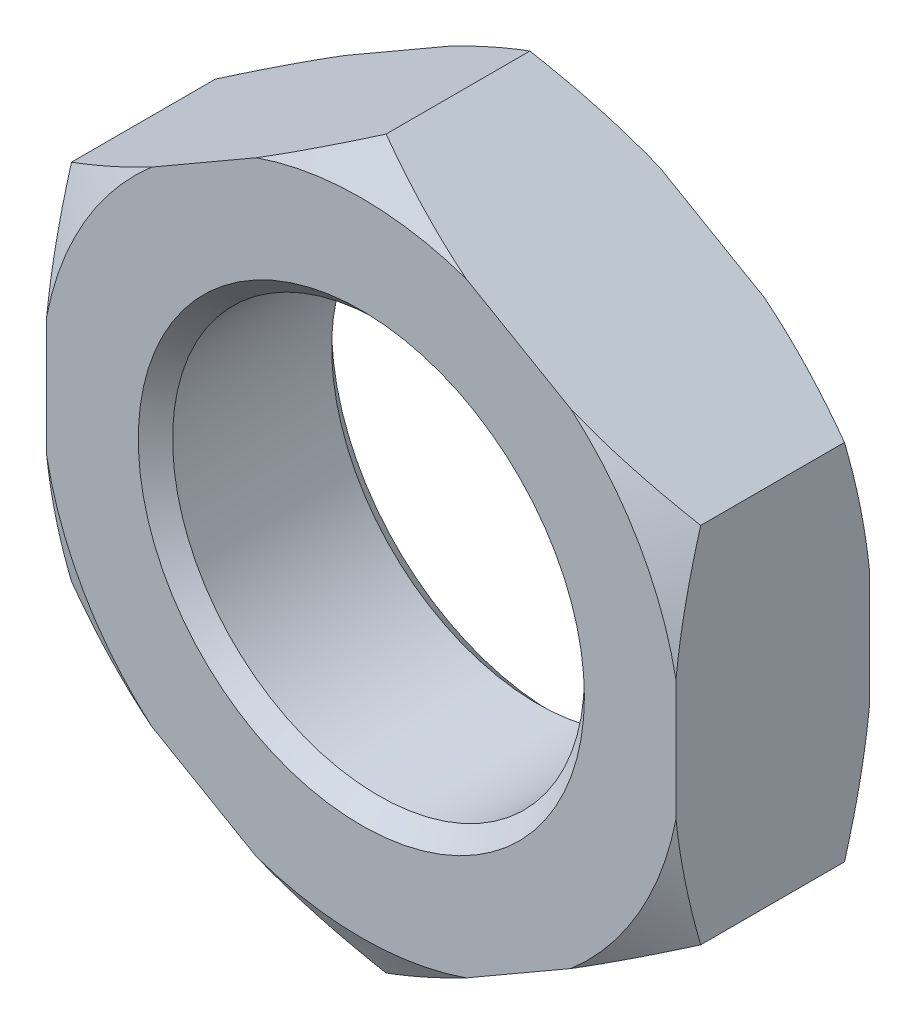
ISO-10303-21;
HEADER;
FILE_DESCRIPTION(('STEP AP214'),'2;1');
FILE_NAME('part.step','',(''),(''),'','','');
FILE_SCHEMA(('AUTOMOTIVE_DESIGN { 1 0 10303 214 1 1 1 1 }'));
ENDSEC;
DATA;
#1=APPLICATION_CONTEXT('core data for automotive mechanical design processes');
#2=APPLICATION_PROTOCOL_DEFINITION('international standard','automotive_design',2000,#1);
#3=PRODUCT_CONTEXT('',#1,'mechanical');
#4=PRODUCT('Part','Part','',(#3));
#5=PRODUCT_RELATED_PRODUCT_CATEGORY('part','',(#4));
#6=PRODUCT_DEFINITION_FORMATION('','',#4);
#7=PRODUCT_DEFINITION_CONTEXT('part definition',#1,'design');
#8=PRODUCT_DEFINITION('design','',#6,#7);
#9=PRODUCT_DEFINITION_SHAPE('','',#8);
#10=(LENGTH_UNIT() NAMED_UNIT(*) SI_UNIT(.MILLI.,.METRE.));
#11=(NAMED_UNIT(*) PLANE_ANGLE_UNIT() SI_UNIT($,.RADIAN.));
#12=(NAMED_UNIT(*) SI_UNIT($,.STERADIAN.) SOLID_ANGLE_UNIT());
#13=UNCERTAINTY_MEASURE_WITH_UNIT(LENGTH_MEASURE(1.E-05),#10,'distance_accuracy_value','');
#14=(GEOMETRIC_REPRESENTATION_CONTEXT(3) GLOBAL_UNCERTAINTY_ASSIGNED_CONTEXT((#13)) GLOBAL_UNIT_ASSIGNED_CONTEXT((#10,
#11,#12)) REPRESENTATION_CONTEXT('',''));
#15=CARTESIAN_POINT('',(0.,0.,0.));
#16=DIRECTION('',(0.,0.,1.));
#17=DIRECTION('',(1.,0.,0.));
#18=AXIS2_PLACEMENT_3D('',#15,#16,#17);
#19=CARTESIAN_POINT('',(27.5,15.8771324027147,8.45));
#20=DIRECTION('',(-0.5,-0.866025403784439,0.));
#21=DIRECTION('',(0.866025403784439,-0.5,0.));
#22=AXIS2_PLACEMENT_3D('',#19,#20,#21);
#23=PLANE('',#22);
#24=CARTESIAN_POINT('',(-19.0969929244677,42.7799188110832,2.42993770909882));
#25=CARTESIAN_POINT('',(-18.6649838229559,42.530498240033,2.19677431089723));
#26=CARTESIAN_POINT('',(-18.2324512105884,42.2807754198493,1.96490507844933));
#27=CARTESIAN_POINT('',(-17.3662472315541,41.7806723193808,1.5040082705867));
#28=CARTESIAN_POINT('',(-16.9325758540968,41.530292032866,1.2749807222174));
#29=CARTESIAN_POINT('',(-15.6296270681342,40.7780342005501,0.59249418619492));
#30=CARTESIAN_POINT('',(-14.7585156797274,40.2750978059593,0.143685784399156));
#31=CARTESIAN_POINT('',(-13.0078241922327,39.2643356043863,-0.740423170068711));
#32=CARTESIAN_POINT('',(-12.1282258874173,38.7564992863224,-1.17567575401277));
#33=CARTESIAN_POINT('',(-10.3624399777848,37.7370223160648,-2.02794488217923));
#34=CARTESIAN_POINT('',(-9.47625258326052,37.2253817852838,-2.44496200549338));
#35=CARTESIAN_POINT('',(-7.67360067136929,36.1846202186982,-3.26708076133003));
#36=CARTESIAN_POINT('',(-6.75693936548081,35.6553855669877,-3.67160953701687));
#37=CARTESIAN_POINT('',(-4.91436187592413,34.5915729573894,-4.45185654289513));
#38=CARTESIAN_POINT('',(-3.98844524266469,34.0569947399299,-4.82757336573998));
#39=CARTESIAN_POINT('',(-2.12718428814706,32.982395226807,-5.54303976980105));
#40=CARTESIAN_POINT('',(-1.1918500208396,32.4423797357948,-5.88282400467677));
#41=CARTESIAN_POINT('',(0.689926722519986,31.3559354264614,-6.5186013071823));
#42=CARTESIAN_POINT('',(1.63636774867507,30.8095074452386,-6.81460002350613));
#43=CARTESIAN_POINT('',(3.24394706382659,29.8813710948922,-7.26939713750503));
#44=CARTESIAN_POINT('',(3.90211177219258,29.501379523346,-7.44221044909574));
#45=CARTESIAN_POINT('',(5.2236072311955,28.7384137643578,-7.75928711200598));
#46=CARTESIAN_POINT('',(5.88693787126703,28.3554396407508,-7.90355107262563));
#47=CARTESIAN_POINT('',(7.21805579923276,27.5869183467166,-8.16026747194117));
#48=CARTESIAN_POINT('',(7.88584188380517,27.2013718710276,-8.27272817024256));
#49=CARTESIAN_POINT('',(9.22513268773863,26.4281319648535,-8.46299542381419));
#50=CARTESIAN_POINT('',(9.89663737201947,26.0404385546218,-8.54080230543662));
#51=CARTESIAN_POINT('',(11.2342980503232,25.2681398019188,-8.65884942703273));
#52=CARTESIAN_POINT('',(11.9004256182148,24.883550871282,-8.69951536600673));
#53=CARTESIAN_POINT('',(13.2335998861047,24.113842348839,-8.7436089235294));
#54=CARTESIAN_POINT('',(13.9006465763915,23.7287227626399,-8.74703693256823));
#55=CARTESIAN_POINT('',(15.2341566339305,22.9588203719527,-8.71654019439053));
#56=CARTESIAN_POINT('',(15.9006199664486,22.5740375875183,-8.68261335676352));
#57=CARTESIAN_POINT('',(16.8986526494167,21.9978231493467,-8.60449644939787));
#58=CARTESIAN_POINT('',(17.2310655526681,21.8059044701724,-8.57391805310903));
#59=CARTESIAN_POINT('',(17.8952102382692,21.4224603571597,-8.50391734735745));
#60=CARTESIAN_POINT('',(18.2269419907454,21.2309349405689,-8.4644946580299));
#61=CARTESIAN_POINT('',(19.0114771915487,20.7779833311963,-8.36098689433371));
#62=CARTESIAN_POINT('',(19.4639134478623,20.5167691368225,-8.2931647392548));
#63=CARTESIAN_POINT('',(20.3668886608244,19.9954361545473,-8.14229985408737));
#64=CARTESIAN_POINT('',(20.8174274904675,19.7353174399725,-8.05925612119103));
#65=CARTESIAN_POINT('',(22.1660166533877,18.9567091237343,-7.78863879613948));
#66=CARTESIAN_POINT('',(23.0608798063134,18.4400596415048,-7.57960077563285));
#67=CARTESIAN_POINT('',(24.8417207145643,17.4118906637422,-7.11217817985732));
#68=CARTESIAN_POINT('',(25.7276879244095,16.9003772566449,-6.85374098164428));
#69=CARTESIAN_POINT('',(27.4896633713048,15.8831002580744,-6.29566856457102));
#70=CARTESIAN_POINT('',(28.3656726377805,15.377336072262,-5.99603764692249));
#71=CARTESIAN_POINT('',(30.1187488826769,14.3651970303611,-5.35890695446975));
#72=CARTESIAN_POINT('',(30.9957032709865,13.8588871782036,-5.02099722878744));
#73=CARTESIAN_POINT('',(32.7403225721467,12.8516307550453,-4.31678404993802));
#74=CARTESIAN_POINT('',(33.6079932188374,12.3506808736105,-3.95049942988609));
#75=CARTESIAN_POINT('',(35.3353751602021,11.3533764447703,-3.19459066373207));
#76=CARTESIAN_POINT('',(36.1950885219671,10.8570207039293,-2.80497278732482));
#77=CARTESIAN_POINT('',(37.9078725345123,9.8681443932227,-2.0064189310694));
#78=CARTESIAN_POINT('',(38.7609422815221,9.37562434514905,-1.59748037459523));
#79=CARTESIAN_POINT('',(40.2012924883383,8.54403776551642,-0.891128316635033));
#80=CARTESIAN_POINT('',(40.7900970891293,8.20409127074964,-0.597841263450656));
#81=CARTESIAN_POINT('',(41.9651239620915,7.52568918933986,-0.00451080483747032));
#82=CARTESIAN_POINT('',(42.5513463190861,7.18723355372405,0.295532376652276));
#83=CARTESIAN_POINT('',(43.7152977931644,6.51522585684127,0.898379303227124));
#84=CARTESIAN_POINT('',(44.2930512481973,6.18165974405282,1.20112048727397));
#85=CARTESIAN_POINT('',(45.4465089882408,5.51571060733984,1.81179646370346));
#86=CARTESIAN_POINT('',(46.0222132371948,5.18332760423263,2.11973134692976));
#87=CARTESIAN_POINT('',(46.5969929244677,4.85147839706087,2.42993770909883));
#88=B_SPLINE_CURVE_WITH_KNOTS('',3,(#24,#25,#26,#27,#28,#29,#30,#31,#32,#33,#34,#35,#36,#37,#38,
#39,#40,#41,#42,#43,#44,#45,#46,#47,#48,#49,#50,#51,#52,#53,#54,#55,#56,#57,#58,#59,#60,#61,#62,
#63,#64,#65,#66,#67,#68,#69,#70,#71,#72,#73,#74,#75,#76,#77,#78,#79,#80,#81,#82,#83,#84,#85,#86,
#87),.UNSPECIFIED.,.F.,.F.,(4,2,2,2,2,2,2,2,2,2,2,2,2,2,2,2,2,2,2,2,2,2,2,2,2,2,2,2,2,2,2,4),
(0.,1.65192537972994,3.30386646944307,6.60813376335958,9.92300452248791,13.2377699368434,
16.6368465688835,20.0360891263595,23.4320229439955,26.8275182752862,29.165204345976,
31.5028405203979,33.8398690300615,36.1768755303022,38.4867468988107,40.7965940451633,
43.1065704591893,44.2616450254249,45.4167692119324,46.9969522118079,48.5772393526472,
51.7383703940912,54.9028878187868,58.0670750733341,61.2690956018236,64.4690087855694,
67.6680659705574,70.867550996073,73.088876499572,75.3101284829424,77.5079361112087,
79.7057822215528),.UNSPECIFIED.);
#89=CARTESIAN_POINT('',(0.,31.7542648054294,-6.28493649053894));
#90=VERTEX_POINT('',#89);
#91=CARTESIAN_POINT('',(9.16833704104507,26.4609229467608,-8.45));
#92=VERTEX_POINT('',#91);
#93=EDGE_CURVE('E169',#90,#92,#88,.T.);
#94=ORIENTED_EDGE('',*,*,#93,.F.);
#95=DIRECTION('',(0.,0.,-1.));
#96=VECTOR('',#95,1.);
#97=CARTESIAN_POINT('',(0.,31.7542648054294,8.45));
#98=LINE('',#97,#96);
#99=CARTESIAN_POINT('',(0.,31.7542648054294,6.28493649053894));
#100=VERTEX_POINT('',#99);
#101=EDGE_CURVE('E206',#100,#90,#98,.T.);
#102=ORIENTED_EDGE('',*,*,#101,.F.);
#103=CARTESIAN_POINT('',(46.5969929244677,4.85147839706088,-2.42993770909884));
#104=CARTESIAN_POINT('',(46.1649838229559,5.10089896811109,-2.19677431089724));
#105=CARTESIAN_POINT('',(45.7324512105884,5.35062178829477,-1.96490507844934));
#106=CARTESIAN_POINT('',(44.8662472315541,5.85072488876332,-1.50400827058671));
#107=CARTESIAN_POINT('',(44.4325758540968,6.10110517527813,-1.27498072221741));
#108=CARTESIAN_POINT('',(43.1296270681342,6.85336300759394,-0.592494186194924));
#109=CARTESIAN_POINT('',(42.2585156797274,7.35629940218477,-0.143685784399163));
#110=CARTESIAN_POINT('',(40.5078241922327,8.36706160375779,0.740423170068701));
#111=CARTESIAN_POINT('',(39.6282258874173,8.87489792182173,1.17567575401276));
#112=CARTESIAN_POINT('',(37.8624399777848,9.89437489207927,2.02794488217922));
#113=CARTESIAN_POINT('',(36.9762525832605,10.4060154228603,2.44496200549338));
#114=CARTESIAN_POINT('',(35.1736006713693,11.4467769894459,3.26708076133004));
#115=CARTESIAN_POINT('',(34.2569393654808,11.9760116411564,3.67160953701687));
#116=CARTESIAN_POINT('',(32.4143618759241,13.0398242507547,4.45185654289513));
#117=CARTESIAN_POINT('',(31.4884452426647,13.5744024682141,4.82757336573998));
#118=CARTESIAN_POINT('',(29.6271842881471,14.649001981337,5.54303976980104));
#119=CARTESIAN_POINT('',(28.6918500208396,15.1890174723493,5.88282400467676));
#120=CARTESIAN_POINT('',(26.81007327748,16.2754617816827,6.51860130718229));
#121=CARTESIAN_POINT('',(25.8636322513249,16.8218897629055,6.81460002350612));
#122=CARTESIAN_POINT('',(24.2560529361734,17.7500261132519,7.26939713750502));
#123=CARTESIAN_POINT('',(23.5978882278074,18.1300176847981,7.44221044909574));
#124=CARTESIAN_POINT('',(22.2763927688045,18.8929834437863,7.75928711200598));
#125=CARTESIAN_POINT('',(21.613062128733,19.2759575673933,7.90355107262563));
#126=CARTESIAN_POINT('',(20.2819442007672,20.0444788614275,8.16026747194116));
#127=CARTESIAN_POINT('',(19.6141581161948,20.4300253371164,8.27272817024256));
#128=CARTESIAN_POINT('',(18.2748673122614,21.2032652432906,8.46299542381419));
#129=CARTESIAN_POINT('',(17.6033626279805,21.5909586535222,8.54080230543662));
#130=CARTESIAN_POINT('',(16.2657019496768,22.3632574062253,8.65884942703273));
#131=CARTESIAN_POINT('',(15.5995743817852,22.7478463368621,8.69951536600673));
#132=CARTESIAN_POINT('',(14.2664001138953,23.5175548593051,8.7436089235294));
#133=CARTESIAN_POINT('',(13.5993534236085,23.9026744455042,8.74703693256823));
#134=CARTESIAN_POINT('',(12.2658433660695,24.6725768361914,8.71654019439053));
#135=CARTESIAN_POINT('',(11.5993800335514,25.0573596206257,8.68261335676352));
#136=CARTESIAN_POINT('',(10.6013473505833,25.6335740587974,8.60449644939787));
#137=CARTESIAN_POINT('',(10.2689344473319,25.8254927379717,8.57391805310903));
#138=CARTESIAN_POINT('',(9.60478976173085,26.2089368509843,8.50391734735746));
#139=CARTESIAN_POINT('',(9.27305800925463,26.4004622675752,8.4644946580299));
#140=CARTESIAN_POINT('',(8.48852280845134,26.8534138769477,8.36098689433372));
#141=CARTESIAN_POINT('',(8.03608655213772,27.1146280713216,8.2931647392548));
#142=CARTESIAN_POINT('',(7.13311133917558,27.6359610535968,8.14229985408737));
#143=CARTESIAN_POINT('',(6.6825725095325,27.8960797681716,8.05925612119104));
#144=CARTESIAN_POINT('',(5.33398334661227,28.6746880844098,7.78863879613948));
#145=CARTESIAN_POINT('',(4.43912019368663,29.1913375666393,7.57960077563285));
#146=CARTESIAN_POINT('',(2.65827928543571,30.2195065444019,7.11217817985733));
#147=CARTESIAN_POINT('',(1.7723120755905,30.7310199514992,6.85374098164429));
#148=CARTESIAN_POINT('',(0.0103366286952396,31.7482969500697,6.29566856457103));
#149=CARTESIAN_POINT('',(-0.865672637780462,32.254061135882,5.9960376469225));
#150=CARTESIAN_POINT('',(-2.61874888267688,33.2662001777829,5.35890695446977));
#151=CARTESIAN_POINT('',(-3.49570327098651,33.7725100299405,5.02099722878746));
#152=CARTESIAN_POINT('',(-5.24032257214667,34.7797664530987,4.31678404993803));
#153=CARTESIAN_POINT('',(-6.10799321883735,35.2807163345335,3.9504994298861));
#154=CARTESIAN_POINT('',(-7.83537516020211,36.2780207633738,3.19459066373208));
#155=CARTESIAN_POINT('',(-8.6950885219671,36.7743765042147,2.80497278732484));
#156=CARTESIAN_POINT('',(-10.4078725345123,37.7632528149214,2.00641893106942));
#157=CARTESIAN_POINT('',(-11.2609422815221,38.255772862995,1.59748037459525));
#158=CARTESIAN_POINT('',(-12.7012924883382,39.0873594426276,0.891128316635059));
#159=CARTESIAN_POINT('',(-13.2900970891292,39.4273059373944,0.597841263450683));
#160=CARTESIAN_POINT('',(-14.4651239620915,40.1057080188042,0.00451080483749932));
#161=CARTESIAN_POINT('',(-15.0513463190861,40.44416365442,-0.295532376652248));
#162=CARTESIAN_POINT('',(-16.2152977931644,41.1161713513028,-0.898379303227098));
#163=CARTESIAN_POINT('',(-16.7930512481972,41.4497374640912,-1.20112048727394));
#164=CARTESIAN_POINT('',(-17.9465089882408,42.1156866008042,-1.81179646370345));
#165=CARTESIAN_POINT('',(-18.5222132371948,42.4480696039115,-2.11973134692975));
#166=CARTESIAN_POINT('',(-19.0969929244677,42.7799188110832,-2.42993770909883));
#167=B_SPLINE_CURVE_WITH_KNOTS('',3,(#103,#104,#105,#106,#107,#108,#109,#110,#111,#112,#113,
#114,#115,#116,#117,#118,#119,#120,#121,#122,#123,#124,#125,#126,#127,#128,#129,#130,#131,#132,
#133,#134,#135,#136,#137,#138,#139,#140,#141,#142,#143,#144,#145,#146,#147,#148,#149,#150,#151,
#152,#153,#154,#155,#156,#157,#158,#159,#160,#161,#162,#163,#164,#165,#166),.UNSPECIFIED.,.F.,
.F.,(4,2,2,2,2,2,2,2,2,2,2,2,2,2,2,2,2,2,2,2,2,2,2,2,2,2,2,2,2,2,2,4),(0.,1.65192537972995,
3.30386646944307,6.60813376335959,9.92300452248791,13.2377699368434,16.6368465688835,
20.0360891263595,23.4320229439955,26.8275182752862,29.165204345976,31.5028405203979,
33.8398690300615,36.1768755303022,38.4867468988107,40.7965940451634,43.1065704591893,
44.2616450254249,45.4167692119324,46.9969522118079,48.5772393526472,51.7383703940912,
54.9028878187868,58.0670750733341,61.2690956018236,64.4690087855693,67.6680659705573,
70.867550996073,73.088876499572,75.3101284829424,77.5079361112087,79.7057822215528),.UNSPECIFIED.);
#168=CARTESIAN_POINT('',(9.16833704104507,26.4609229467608,8.45));
#169=VERTEX_POINT('',#168);
#170=EDGE_CURVE('E338',#169,#100,#167,.T.);
#171=ORIENTED_EDGE('',*,*,#170,.F.);
#172=DIRECTION('',(-0.866025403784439,0.5,0.));
#173=VECTOR('',#172,1.);
#174=CARTESIAN_POINT('',(27.5,15.8771324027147,8.45));
#175=LINE('',#174,#173);
#176=CARTESIAN_POINT('',(18.3316629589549,21.1704742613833,8.45));
#177=VERTEX_POINT('',#176);
#178=EDGE_CURVE('E322',#177,#169,#175,.T.);
#179=ORIENTED_EDGE('',*,*,#178,.F.);
#180=CARTESIAN_POINT('',(27.5,15.8771324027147,6.28493649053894));
#181=VERTEX_POINT('',#180);
#182=EDGE_CURVE('E185',#181,#177,#167,.T.);
#183=ORIENTED_EDGE('',*,*,#182,.F.);
#184=DIRECTION('',(0.,0.,-1.));
#185=VECTOR('',#184,1.);
#186=CARTESIAN_POINT('',(27.5,15.8771324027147,8.45));
#187=LINE('',#186,#185);
#188=CARTESIAN_POINT('',(27.5,15.8771324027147,-6.28493649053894));
#189=VERTEX_POINT('',#188);
#190=EDGE_CURVE('E175',#181,#189,#187,.T.);
#191=ORIENTED_EDGE('',*,*,#190,.T.);
#192=CARTESIAN_POINT('',(18.3316629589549,21.1704742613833,-8.45));
#193=VERTEX_POINT('',#192);
#194=EDGE_CURVE('E157',#193,#189,#88,.T.);
#195=ORIENTED_EDGE('',*,*,#194,.F.);
#196=DIRECTION('',(-0.866025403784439,0.5,0.));
#197=VECTOR('',#196,1.);
#198=CARTESIAN_POINT('',(27.5,15.8771324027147,-8.45));
#199=LINE('',#198,#197);
#200=EDGE_CURVE('E241',#193,#92,#199,.T.);
#201=ORIENTED_EDGE('',*,*,#200,.T.);
#202=EDGE_LOOP('',(#94,#102,#171,#179,#183,#191,#195,#201));
#203=FACE_BOUND('',#202,.T.);
#204=ADVANCED_FACE('F33',(#203),#23,.F.);
#205=CARTESIAN_POINT('',(0.,31.7542648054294,8.45));
#206=DIRECTION('',(0.5,-0.866025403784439,0.));
#207=DIRECTION('',(0.866025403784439,0.5,0.));
#208=AXIS2_PLACEMENT_3D('',#205,#206,#207);
#209=PLANE('',#208);
#210=CARTESIAN_POINT('',(-46.5969929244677,4.85147839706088,2.42993770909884));
#211=CARTESIAN_POINT('',(-46.1649838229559,5.10089896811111,2.19677431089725));
#212=CARTESIAN_POINT('',(-45.7324512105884,5.35062178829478,1.96490507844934));
#213=CARTESIAN_POINT('',(-44.8662472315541,5.85072488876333,1.50400827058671));
#214=CARTESIAN_POINT('',(-44.4325758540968,6.10110517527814,1.27498072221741));
#215=CARTESIAN_POINT('',(-43.1296270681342,6.85336300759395,0.592494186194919));
#216=CARTESIAN_POINT('',(-42.2585156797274,7.35629940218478,0.143685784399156));
#217=CARTESIAN_POINT('',(-40.5078241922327,8.36706160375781,-0.740423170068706));
#218=CARTESIAN_POINT('',(-39.6282258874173,8.87489792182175,-1.17567575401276));
#219=CARTESIAN_POINT('',(-37.8624399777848,9.89437489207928,-2.02794488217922));
#220=CARTESIAN_POINT('',(-36.9762525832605,10.4060154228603,-2.44496200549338));
#221=CARTESIAN_POINT('',(-35.1736006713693,11.4467769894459,-3.26708076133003));
#222=CARTESIAN_POINT('',(-34.2569393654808,11.9760116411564,-3.67160953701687));
#223=CARTESIAN_POINT('',(-32.4143618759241,13.0398242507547,-4.45185654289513));
#224=CARTESIAN_POINT('',(-31.4884452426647,13.5744024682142,-4.82757336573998));
#225=CARTESIAN_POINT('',(-29.6271842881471,14.649001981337,-5.54303976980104));
#226=CARTESIAN_POINT('',(-28.6918500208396,15.1890174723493,-5.88282400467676));
#227=CARTESIAN_POINT('',(-26.81007327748,16.2754617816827,-6.51860130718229));
#228=CARTESIAN_POINT('',(-25.8636322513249,16.8218897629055,-6.81460002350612));
#229=CARTESIAN_POINT('',(-24.2560529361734,17.7500261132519,-7.26939713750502));
#230=CARTESIAN_POINT('',(-23.5978882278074,18.1300176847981,-7.44221044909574));
#231=CARTESIAN_POINT('',(-22.2763927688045,18.8929834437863,-7.75928711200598));
#232=CARTESIAN_POINT('',(-21.613062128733,19.2759575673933,-7.90355107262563));
#233=CARTESIAN_POINT('',(-20.2819442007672,20.0444788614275,-8.16026747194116));
#234=CARTESIAN_POINT('',(-19.6141581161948,20.4300253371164,-8.27272817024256));
#235=CARTESIAN_POINT('',(-18.2748673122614,21.2032652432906,-8.46299542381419));
#236=CARTESIAN_POINT('',(-17.6033626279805,21.5909586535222,-8.54080230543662));
#237=CARTESIAN_POINT('',(-16.2657019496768,22.3632574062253,-8.65884942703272));
#238=CARTESIAN_POINT('',(-15.5995743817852,22.7478463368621,-8.69951536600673));
#239=CARTESIAN_POINT('',(-14.2664001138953,23.5175548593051,-8.7436089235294));
#240=CARTESIAN_POINT('',(-13.5993534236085,23.9026744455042,-8.74703693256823));
#241=CARTESIAN_POINT('',(-12.2658433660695,24.6725768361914,-8.71654019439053));
#242=CARTESIAN_POINT('',(-11.5993800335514,25.0573596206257,-8.68261335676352));
#243=CARTESIAN_POINT('',(-10.6013473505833,25.6335740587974,-8.60449644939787));
#244=CARTESIAN_POINT('',(-10.2689344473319,25.8254927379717,-8.57391805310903));
#245=CARTESIAN_POINT('',(-9.60478976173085,26.2089368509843,-8.50391734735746));
#246=CARTESIAN_POINT('',(-9.27305800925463,26.4004622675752,-8.4644946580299));
#247=CARTESIAN_POINT('',(-8.48852280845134,26.8534138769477,-8.36098689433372));
#248=CARTESIAN_POINT('',(-8.03608655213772,27.1146280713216,-8.2931647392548));
#249=CARTESIAN_POINT('',(-7.13311133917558,27.6359610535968,-8.14229985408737));
#250=CARTESIAN_POINT('',(-6.68257250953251,27.8960797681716,-8.05925612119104));
#251=CARTESIAN_POINT('',(-5.33398334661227,28.6746880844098,-7.78863879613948));
#252=CARTESIAN_POINT('',(-4.43912019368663,29.1913375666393,-7.57960077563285));
#253=CARTESIAN_POINT('',(-2.65827928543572,30.2195065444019,-7.11217817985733));
#254=CARTESIAN_POINT('',(-1.7723120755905,30.7310199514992,-6.85374098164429));
#255=CARTESIAN_POINT('',(-0.0103366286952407,31.7482969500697,-6.29566856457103));
#256=CARTESIAN_POINT('',(0.865672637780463,32.254061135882,-5.9960376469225));
#257=CARTESIAN_POINT('',(2.61874888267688,33.2662001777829,-5.35890695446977));
#258=CARTESIAN_POINT('',(3.49570327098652,33.7725100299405,-5.02099722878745));
#259=CARTESIAN_POINT('',(5.24032257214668,34.7797664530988,-4.31678404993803));
#260=CARTESIAN_POINT('',(6.10799321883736,35.2807163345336,-3.9504994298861));
#261=CARTESIAN_POINT('',(7.83537516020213,36.2780207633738,-3.19459066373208));
#262=CARTESIAN_POINT('',(8.69508852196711,36.7743765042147,-2.80497278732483));
#263=CARTESIAN_POINT('',(10.4078725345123,37.7632528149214,-2.00641893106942));
#264=CARTESIAN_POINT('',(11.2609422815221,38.255772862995,-1.59748037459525));
#265=CARTESIAN_POINT('',(12.7012924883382,39.0873594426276,-0.891128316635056));
#266=CARTESIAN_POINT('',(13.2900970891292,39.4273059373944,-0.597841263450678));
#267=CARTESIAN_POINT('',(14.4651239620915,40.1057080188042,-0.00451080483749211));
#268=CARTESIAN_POINT('',(15.0513463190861,40.44416365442,0.295532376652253));
#269=CARTESIAN_POINT('',(16.2152977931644,41.1161713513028,0.898379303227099));
#270=CARTESIAN_POINT('',(16.7930512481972,41.4497374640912,1.20112048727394));
#271=CARTESIAN_POINT('',(17.9465089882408,42.1156866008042,1.81179646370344));
#272=CARTESIAN_POINT('',(18.5222132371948,42.4480696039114,2.11973134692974));
#273=CARTESIAN_POINT('',(19.0969929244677,42.7799188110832,2.42993770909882));
#274=B_SPLINE_CURVE_WITH_KNOTS('',3,(#210,#211,#212,#213,#214,#215,#216,#217,#218,#219,#220,
#221,#222,#223,#224,#225,#226,#227,#228,#229,#230,#231,#232,#233,#234,#235,#236,#237,#238,#239,
#240,#241,#242,#243,#244,#245,#246,#247,#248,#249,#250,#251,#252,#253,#254,#255,#256,#257,#258,
#259,#260,#261,#262,#263,#264,#265,#266,#267,#268,#269,#270,#271,#272,#273),.UNSPECIFIED.,.F.,
.F.,(4,2,2,2,2,2,2,2,2,2,2,2,2,2,2,2,2,2,2,2,2,2,2,2,2,2,2,2,2,2,2,4),(0.,1.65192537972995,
3.30386646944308,6.6081337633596,9.92300452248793,13.2377699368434,16.6368465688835,
20.0360891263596,23.4320229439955,26.8275182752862,29.165204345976,31.5028405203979,
33.8398690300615,36.1768755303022,38.4867468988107,40.7965940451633,43.1065704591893,
44.2616450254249,45.4167692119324,46.9969522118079,48.5772393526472,51.7383703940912,
54.9028878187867,58.0670750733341,61.2690956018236,64.4690087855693,67.6680659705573,
70.867550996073,73.088876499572,75.3101284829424,77.5079361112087,79.7057822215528),.UNSPECIFIED.);
#275=CARTESIAN_POINT('',(-27.5,15.8771324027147,-6.28493649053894));
#276=VERTEX_POINT('',#275);
#277=CARTESIAN_POINT('',(-18.3316629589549,21.1704742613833,-8.45));
#278=VERTEX_POINT('',#277);
#279=EDGE_CURVE('E48',#276,#278,#274,.T.);
#280=ORIENTED_EDGE('',*,*,#279,.F.);
#281=DIRECTION('',(0.,0.,-1.));
#282=VECTOR('',#281,1.);
#283=CARTESIAN_POINT('',(-27.5,15.8771324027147,8.45));
#284=LINE('',#283,#282);
#285=CARTESIAN_POINT('',(-27.5,15.8771324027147,6.28493649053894));
#286=VERTEX_POINT('',#285);
#287=EDGE_CURVE('E203',#286,#276,#284,.T.);
#288=ORIENTED_EDGE('',*,*,#287,.F.);
#289=CARTESIAN_POINT('',(19.0969929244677,42.7799188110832,-2.42993770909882));
#290=CARTESIAN_POINT('',(18.6649838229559,42.530498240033,-2.19677431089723));
#291=CARTESIAN_POINT('',(18.2324512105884,42.2807754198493,-1.96490507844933));
#292=CARTESIAN_POINT('',(17.3662472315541,41.7806723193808,-1.5040082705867));
#293=CARTESIAN_POINT('',(16.9325758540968,41.530292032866,-1.2749807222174));
#294=CARTESIAN_POINT('',(15.6296270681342,40.7780342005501,-0.592494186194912));
#295=CARTESIAN_POINT('',(14.7585156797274,40.2750978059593,-0.143685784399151));
#296=CARTESIAN_POINT('',(13.0078241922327,39.2643356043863,0.740423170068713));
#297=CARTESIAN_POINT('',(12.1282258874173,38.7564992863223,1.17567575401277));
#298=CARTESIAN_POINT('',(10.3624399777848,37.7370223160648,2.02794488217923));
#299=CARTESIAN_POINT('',(9.47625258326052,37.2253817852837,2.44496200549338));
#300=CARTESIAN_POINT('',(7.67360067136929,36.1846202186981,3.26708076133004));
#301=CARTESIAN_POINT('',(6.75693936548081,35.6553855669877,3.67160953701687));
#302=CARTESIAN_POINT('',(4.91436187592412,34.5915729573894,4.45185654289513));
#303=CARTESIAN_POINT('',(3.98844524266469,34.0569947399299,4.82757336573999));
#304=CARTESIAN_POINT('',(2.12718428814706,32.982395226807,5.54303976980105));
#305=CARTESIAN_POINT('',(1.1918500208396,32.4423797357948,5.88282400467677));
#306=CARTESIAN_POINT('',(-0.68992672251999,31.3559354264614,6.5186013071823));
#307=CARTESIAN_POINT('',(-1.63636774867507,30.8095074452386,6.81460002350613));
#308=CARTESIAN_POINT('',(-3.2439470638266,29.8813710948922,7.26939713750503));
#309=CARTESIAN_POINT('',(-3.90211177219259,29.501379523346,7.44221044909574));
#310=CARTESIAN_POINT('',(-5.2236072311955,28.7384137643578,7.75928711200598));
#311=CARTESIAN_POINT('',(-5.88693787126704,28.3554396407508,7.90355107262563));
#312=CARTESIAN_POINT('',(-7.21805579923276,27.5869183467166,8.16026747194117));
#313=CARTESIAN_POINT('',(-7.88584188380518,27.2013718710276,8.27272817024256));
#314=CARTESIAN_POINT('',(-9.22513268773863,26.4281319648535,8.46299542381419));
#315=CARTESIAN_POINT('',(-9.89663737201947,26.0404385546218,8.54080230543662));
#316=CARTESIAN_POINT('',(-11.2342980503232,25.2681398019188,8.65884942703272));
#317=CARTESIAN_POINT('',(-11.9004256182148,24.883550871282,8.69951536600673));
#318=CARTESIAN_POINT('',(-13.2335998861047,24.113842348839,8.7436089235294));
#319=CARTESIAN_POINT('',(-13.9006465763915,23.7287227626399,8.74703693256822));
#320=CARTESIAN_POINT('',(-15.2341566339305,22.9588203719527,8.71654019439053));
#321=CARTESIAN_POINT('',(-15.9006199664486,22.5740375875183,8.68261335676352));
#322=CARTESIAN_POINT('',(-16.8986526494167,21.9978231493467,8.60449644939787));
#323=CARTESIAN_POINT('',(-17.2310655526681,21.8059044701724,8.57391805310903));
#324=CARTESIAN_POINT('',(-17.8952102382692,21.4224603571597,8.50391734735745));
#325=CARTESIAN_POINT('',(-18.2269419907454,21.2309349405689,8.4644946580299));
#326=CARTESIAN_POINT('',(-19.0114771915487,20.7779833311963,8.36098689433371));
#327=CARTESIAN_POINT('',(-19.4639134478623,20.5167691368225,8.29316473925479));
#328=CARTESIAN_POINT('',(-20.3668886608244,19.9954361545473,8.14229985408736));
#329=CARTESIAN_POINT('',(-20.8174274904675,19.7353174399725,8.05925612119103));
#330=CARTESIAN_POINT('',(-22.1660166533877,18.9567091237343,7.78863879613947));
#331=CARTESIAN_POINT('',(-23.0608798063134,18.4400596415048,7.57960077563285));
#332=CARTESIAN_POINT('',(-24.8417207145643,17.4118906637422,7.11217817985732));
#333=CARTESIAN_POINT('',(-25.7276879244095,16.9003772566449,6.85374098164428));
#334=CARTESIAN_POINT('',(-27.4896633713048,15.8831002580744,6.29566856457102));
#335=CARTESIAN_POINT('',(-28.3656726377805,15.377336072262,5.99603764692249));
#336=CARTESIAN_POINT('',(-30.1187488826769,14.3651970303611,5.35890695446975));
#337=CARTESIAN_POINT('',(-30.9957032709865,13.8588871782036,5.02099722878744));
#338=CARTESIAN_POINT('',(-32.7403225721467,12.8516307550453,4.31678404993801));
#339=CARTESIAN_POINT('',(-33.6079932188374,12.3506808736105,3.95049942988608));
#340=CARTESIAN_POINT('',(-35.3353751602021,11.3533764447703,3.19459066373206));
#341=CARTESIAN_POINT('',(-36.1950885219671,10.8570207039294,2.80497278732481));
#342=CARTESIAN_POINT('',(-37.9078725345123,9.86814439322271,2.0064189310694));
#343=CARTESIAN_POINT('',(-38.7609422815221,9.37562434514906,1.59748037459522));
#344=CARTESIAN_POINT('',(-40.2012924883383,8.54403776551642,0.891128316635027));
#345=CARTESIAN_POINT('',(-40.7900970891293,8.20409127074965,0.59784126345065));
#346=CARTESIAN_POINT('',(-41.9651239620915,7.52568918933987,0.0045108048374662));
#347=CARTESIAN_POINT('',(-42.5513463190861,7.18723355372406,-0.295532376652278));
#348=CARTESIAN_POINT('',(-43.7152977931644,6.51522585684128,-0.898379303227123));
#349=CARTESIAN_POINT('',(-44.2930512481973,6.18165974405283,-1.20112048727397));
#350=CARTESIAN_POINT('',(-45.4465089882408,5.51571060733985,-1.81179646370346));
#351=CARTESIAN_POINT('',(-46.0222132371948,5.18332760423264,-2.11973134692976));
#352=CARTESIAN_POINT('',(-46.5969929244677,4.85147839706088,-2.42993770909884));
#353=B_SPLINE_CURVE_WITH_KNOTS('',3,(#289,#290,#291,#292,#293,#294,#295,#296,#297,#298,#299,
#300,#301,#302,#303,#304,#305,#306,#307,#308,#309,#310,#311,#312,#313,#314,#315,#316,#317,#318,
#319,#320,#321,#322,#323,#324,#325,#326,#327,#328,#329,#330,#331,#332,#333,#334,#335,#336,#337,
#338,#339,#340,#341,#342,#343,#344,#345,#346,#347,#348,#349,#350,#351,#352),.UNSPECIFIED.,.F.,
.F.,(4,2,2,2,2,2,2,2,2,2,2,2,2,2,2,2,2,2,2,2,2,2,2,2,2,2,2,2,2,2,2,4),(0.,1.65192537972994,
3.30386646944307,6.60813376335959,9.92300452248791,13.2377699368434,16.6368465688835,
20.0360891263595,23.4320229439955,26.8275182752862,29.165204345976,31.5028405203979,
33.8398690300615,36.1768755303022,38.4867468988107,40.7965940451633,43.1065704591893,
44.2616450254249,45.4167692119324,46.9969522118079,48.5772393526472,51.7383703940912,
54.9028878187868,58.0670750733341,61.2690956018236,64.4690087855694,67.6680659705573,
70.867550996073,73.088876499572,75.3101284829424,77.5079361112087,79.7057822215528),.UNSPECIFIED.);
#354=CARTESIAN_POINT('',(-18.3316629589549,21.1704742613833,8.45));
#355=VERTEX_POINT('',#354);
#356=EDGE_CURVE('E316',#355,#286,#353,.T.);
#357=ORIENTED_EDGE('',*,*,#356,.F.);
#358=DIRECTION('',(-0.866025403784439,-0.5,0.));
#359=VECTOR('',#358,1.);
#360=CARTESIAN_POINT('',(0.,31.7542648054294,8.45));
#361=LINE('',#360,#359);
#362=CARTESIAN_POINT('',(-9.16833704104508,26.4609229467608,8.45));
#363=VERTEX_POINT('',#362);
#364=EDGE_CURVE('E325',#363,#355,#361,.T.);
#365=ORIENTED_EDGE('',*,*,#364,.F.);
#366=EDGE_CURVE('E321',#100,#363,#353,.T.);
#367=ORIENTED_EDGE('',*,*,#366,.F.);
#368=ORIENTED_EDGE('',*,*,#101,.T.);
#369=CARTESIAN_POINT('',(-9.16833704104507,26.4609229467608,-8.45));
#370=VERTEX_POINT('',#369);
#371=EDGE_CURVE('E582',#370,#90,#274,.T.);
#372=ORIENTED_EDGE('',*,*,#371,.F.);
#373=DIRECTION('',(-0.866025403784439,-0.5,0.));
#374=VECTOR('',#373,1.);
#375=CARTESIAN_POINT('',(0.,31.7542648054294,-8.45));
#376=LINE('',#375,#374);
#377=EDGE_CURVE('E337',#370,#278,#376,.T.);
#378=ORIENTED_EDGE('',*,*,#377,.T.);
#379=EDGE_LOOP('',(#280,#288,#357,#365,#367,#368,#372,#378));
#380=FACE_BOUND('',#379,.T.);
#381=ADVANCED_FACE('F297',(#380),#209,.F.);
#382=CARTESIAN_POINT('',(-27.5,15.8771324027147,8.45));
#383=DIRECTION('',(1.,0.,0.));
#384=DIRECTION('',(0.,0.,-1.));
#385=AXIS2_PLACEMENT_3D('',#382,#383,#384);
#386=PLANE('',#385);
#387=CARTESIAN_POINT('',(-27.5,-34.9741253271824,1.06855846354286));
#388=CARTESIAN_POINT('',(-27.5,-34.4773777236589,0.843112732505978));
#389=CARTESIAN_POINT('',(-27.5,-33.9799437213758,0.61918060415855));
#390=CARTESIAN_POINT('',(-27.5,-32.9835809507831,0.174649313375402));
#391=CARTESIAN_POINT('',(-27.5,-32.4846521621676,-0.0459498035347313));
#392=CARTESIAN_POINT('',(-27.5,-30.9852932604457,-0.702353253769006));
#393=CARTESIAN_POINT('',(-27.5,-29.9824572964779,-1.13268779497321));
#394=CARTESIAN_POINT('',(-27.5,-27.9651748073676,-1.97747451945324));
#395=CARTESIAN_POINT('',(-27.5,-26.9506972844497,-2.39185287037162));
#396=CARTESIAN_POINT('',(-27.5,-24.9131674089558,-3.19891393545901));
#397=CARTESIAN_POINT('',(-27.5,-23.8901154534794,-3.5915976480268));
#398=CARTESIAN_POINT('',(-27.5,-21.838768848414,-4.34873213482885));
#399=CARTESIAN_POINT('',(-27.5,-20.8105181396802,-4.71330137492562));
#400=CARTESIAN_POINT('',(-27.5,-18.7430262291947,-5.4102273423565));
#401=CARTESIAN_POINT('',(-27.5,-17.7037844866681,-5.7425824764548));
#402=CARTESIAN_POINT('',(-27.5,-15.614802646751,-6.36746956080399));
#403=CARTESIAN_POINT('',(-27.5,-14.5650782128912,-6.6600534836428));
#404=CARTESIAN_POINT('',(-27.5,-12.4534823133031,-7.19757242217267));
#405=CARTESIAN_POINT('',(-27.5,-11.3916125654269,-7.44251409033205));
#406=CARTESIAN_POINT('',(-27.5,-9.5585157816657,-7.81448354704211));
#407=CARTESIAN_POINT('',(-27.5,-8.79007817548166,-7.95526401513));
#408=CARTESIAN_POINT('',(-27.5,-7.24795127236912,-8.20450438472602));
#409=CARTESIAN_POINT('',(-27.5,-6.47426214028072,-8.31296529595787));
#410=CARTESIAN_POINT('',(-27.5,-4.92292728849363,-8.4946987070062));
#411=CARTESIAN_POINT('',(-27.5,-4.14528261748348,-8.56798008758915));
#412=CARTESIAN_POINT('',(-27.5,-2.58735480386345,-8.67726696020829));
#413=CARTESIAN_POINT('',(-27.5,-1.80707166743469,-8.71327253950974));
#414=CARTESIAN_POINT('',(-27.5,-0.24607101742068,-8.74688492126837));
#415=CARTESIAN_POINT('',(-27.5,0.534646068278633,-8.74451140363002));
#416=CARTESIAN_POINT('',(-27.5,2.09500984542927,-8.70148934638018));
#417=CARTESIAN_POINT('',(-27.5,2.87465654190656,-8.66084098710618));
#418=CARTESIAN_POINT('',(-27.5,4.43119347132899,-8.5425104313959));
#419=CARTESIAN_POINT('',(-27.5,5.20808341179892,-8.4648244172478));
#420=CARTESIAN_POINT('',(-27.5,6.7575707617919,-8.27465444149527));
#421=CARTESIAN_POINT('',(-27.5,7.53016799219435,-8.16216903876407));
#422=CARTESIAN_POINT('',(-27.5,9.45480305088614,-7.84108445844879));
#423=CARTESIAN_POINT('',(-27.5,10.6035296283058,-7.61254484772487));
#424=CARTESIAN_POINT('',(-27.5,12.8872054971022,-7.09470947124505));
#425=CARTESIAN_POINT('',(-27.5,14.0221516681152,-6.80540020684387));
#426=CARTESIAN_POINT('',(-27.5,16.2805164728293,-6.17624694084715));
#427=CARTESIAN_POINT('',(-27.5,17.4039040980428,-5.83629270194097));
#428=CARTESIAN_POINT('',(-27.5,19.6374384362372,-5.11595488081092));
#429=CARTESIAN_POINT('',(-27.5,20.7475860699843,-4.73557412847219));
#430=CARTESIAN_POINT('',(-27.5,22.9687738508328,-3.93776368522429));
#431=CARTESIAN_POINT('',(-27.5,24.0796786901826,-3.51995967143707));
#432=CARTESIAN_POINT('',(-27.5,26.2911089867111,-2.65764264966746));
#433=CARTESIAN_POINT('',(-27.5,27.3916337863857,-2.21312796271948));
#434=CARTESIAN_POINT('',(-27.5,29.0322665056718,-1.5316218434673));
#435=CARTESIAN_POINT('',(-27.5,29.575765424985,-1.30273698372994));
#436=CARTESIAN_POINT('',(-27.5,30.6607178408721,-0.840158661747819));
#437=CARTESIAN_POINT('',(-27.5,31.2021713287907,-0.606465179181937));
#438=CARTESIAN_POINT('',(-27.5,32.283054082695,-0.134803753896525));
#439=CARTESIAN_POINT('',(-27.5,32.822483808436,0.103163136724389));
#440=CARTESIAN_POINT('',(-27.5,33.8995849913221,0.583019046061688));
#441=CARTESIAN_POINT('',(-27.5,34.4372564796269,0.82490799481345));
#442=CARTESIAN_POINT('',(-27.5,34.9741253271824,1.06855846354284));
#443=B_SPLINE_CURVE_WITH_KNOTS('',3,(#387,#388,#389,#390,#391,#392,#393,#394,#395,#396,#397,
#398,#399,#400,#401,#402,#403,#404,#405,#406,#407,#408,#409,#410,#411,#412,#413,#414,#415,#416,
#417,#418,#419,#420,#421,#422,#423,#424,#425,#426,#427,#428,#429,#430,#431,#432,#433,#434,#435,
#436,#437,#438,#439,#440,#441,#442),.UNSPECIFIED.,.F.,.F.,(4,2,2,2,2,2,2,2,2,2,2,2,2,2,2,2,2,2,
2,2,2,2,2,2,2,2,2,4),(0.,1.63653295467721,3.27308824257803,6.54674821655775,9.83407950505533,
13.1212593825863,16.3937308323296,19.6663640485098,22.9346786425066,26.202536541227,
28.5456198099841,30.8886298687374,33.2310481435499,35.5734609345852,37.9146726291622,
40.2558732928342,42.5973153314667,44.9388543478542,48.450461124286,51.9628487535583,
55.4829965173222,59.0028980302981,62.563100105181,66.1235261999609,67.892693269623,
69.6618678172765,71.430612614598,73.199325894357),.UNSPECIFIED.);
#444=CARTESIAN_POINT('',(-27.4999999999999,-15.8771324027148,-6.28493649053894));
#445=VERTEX_POINT('',#444);
#446=CARTESIAN_POINT('',(-27.5,-5.29044868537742,-8.45));
#447=VERTEX_POINT('',#446);
#448=EDGE_CURVE('E56',#445,#447,#443,.T.);
#449=ORIENTED_EDGE('',*,*,#448,.F.);
#450=DIRECTION('',(0.,0.,-1.));
#451=VECTOR('',#450,1.);
#452=CARTESIAN_POINT('',(-27.5,-15.8771324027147,8.45));
#453=LINE('',#452,#451);
#454=CARTESIAN_POINT('',(-27.4999999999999,-15.8771324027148,6.28493649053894));
#455=VERTEX_POINT('',#454);
#456=EDGE_CURVE('E200',#455,#445,#453,.T.);
#457=ORIENTED_EDGE('',*,*,#456,.F.);
#458=CARTESIAN_POINT('',(-27.5,34.9741253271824,-1.06855846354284));
#459=CARTESIAN_POINT('',(-27.5,34.4773777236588,-0.84311273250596));
#460=CARTESIAN_POINT('',(-27.5,33.9799437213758,-0.619180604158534));
#461=CARTESIAN_POINT('',(-27.5,32.9835809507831,-0.174649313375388));
#462=CARTESIAN_POINT('',(-27.5,32.4846521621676,0.0459498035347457));
#463=CARTESIAN_POINT('',(-27.5,30.9852932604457,0.70235325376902));
#464=CARTESIAN_POINT('',(-27.5,29.9824572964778,1.13268779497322));
#465=CARTESIAN_POINT('',(-27.5,27.9651748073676,1.97747451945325));
#466=CARTESIAN_POINT('',(-27.5,26.9506972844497,2.39185287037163));
#467=CARTESIAN_POINT('',(-27.5,24.9131674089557,3.19891393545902));
#468=CARTESIAN_POINT('',(-27.5,23.8901154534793,3.59159764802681));
#469=CARTESIAN_POINT('',(-27.5,21.838768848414,4.34873213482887));
#470=CARTESIAN_POINT('',(-27.5,20.8105181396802,4.71330137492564));
#471=CARTESIAN_POINT('',(-27.5,18.7430262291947,5.41022734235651));
#472=CARTESIAN_POINT('',(-27.5,17.7037844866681,5.74258247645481));
#473=CARTESIAN_POINT('',(-27.5,15.6148026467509,6.367469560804));
#474=CARTESIAN_POINT('',(-27.5,14.5650782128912,6.66005348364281));
#475=CARTESIAN_POINT('',(-27.5,12.4534823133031,7.19757242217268));
#476=CARTESIAN_POINT('',(-27.5,11.3916125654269,7.44251409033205));
#477=CARTESIAN_POINT('',(-27.5,9.55851578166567,7.81448354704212));
#478=CARTESIAN_POINT('',(-27.5,8.79007817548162,7.95526401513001));
#479=CARTESIAN_POINT('',(-27.5,7.24795127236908,8.20450438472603));
#480=CARTESIAN_POINT('',(-27.5,6.47426214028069,8.31296529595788));
#481=CARTESIAN_POINT('',(-27.5,4.9229272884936,8.4946987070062));
#482=CARTESIAN_POINT('',(-27.5,4.14528261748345,8.56798008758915));
#483=CARTESIAN_POINT('',(-27.5,2.58735480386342,8.67726696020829));
#484=CARTESIAN_POINT('',(-27.5,1.80707166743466,8.71327253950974));
#485=CARTESIAN_POINT('',(-27.5,0.246071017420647,8.74688492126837));
#486=CARTESIAN_POINT('',(-27.5,-0.534646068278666,8.74451140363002));
#487=CARTESIAN_POINT('',(-27.5,-2.09500984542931,8.70148934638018));
#488=CARTESIAN_POINT('',(-27.5,-2.87465654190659,8.66084098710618));
#489=CARTESIAN_POINT('',(-27.5,-4.43119347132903,8.5425104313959));
#490=CARTESIAN_POINT('',(-27.5,-5.20808341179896,8.46482441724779));
#491=CARTESIAN_POINT('',(-27.5,-6.75757076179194,8.27465444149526));
#492=CARTESIAN_POINT('',(-27.5,-7.53016799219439,8.16216903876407));
#493=CARTESIAN_POINT('',(-27.5,-9.45480305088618,7.84108445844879));
#494=CARTESIAN_POINT('',(-27.5,-10.6035296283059,7.61254484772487));
#495=CARTESIAN_POINT('',(-27.5,-12.8872054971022,7.09470947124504));
#496=CARTESIAN_POINT('',(-27.5,-14.0221516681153,6.80540020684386));
#497=CARTESIAN_POINT('',(-27.5,-16.2805164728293,6.17624694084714));
#498=CARTESIAN_POINT('',(-27.5,-17.4039040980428,5.83629270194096));
#499=CARTESIAN_POINT('',(-27.5,-19.6374384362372,5.11595488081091));
#500=CARTESIAN_POINT('',(-27.5,-20.7475860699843,4.73557412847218));
#501=CARTESIAN_POINT('',(-27.5,-22.9687738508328,3.93776368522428));
#502=CARTESIAN_POINT('',(-27.5,-24.0796786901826,3.51995967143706));
#503=CARTESIAN_POINT('',(-27.5,-26.2911089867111,2.65764264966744));
#504=CARTESIAN_POINT('',(-27.5,-27.3916337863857,2.21312796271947));
#505=CARTESIAN_POINT('',(-27.5,-29.0322665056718,1.53162184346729));
#506=CARTESIAN_POINT('',(-27.5,-29.575765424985,1.30273698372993));
#507=CARTESIAN_POINT('',(-27.5,-30.6607178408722,0.840158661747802));
#508=CARTESIAN_POINT('',(-27.5,-31.2021713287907,0.606465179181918));
#509=CARTESIAN_POINT('',(-27.5,-32.283054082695,0.13480375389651));
#510=CARTESIAN_POINT('',(-27.5,-32.822483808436,-0.103163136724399));
#511=CARTESIAN_POINT('',(-27.5,-33.8995849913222,-0.583019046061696));
#512=CARTESIAN_POINT('',(-27.5,-34.4372564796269,-0.82490799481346));
#513=CARTESIAN_POINT('',(-27.5,-34.9741253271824,-1.06855846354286));
#514=B_SPLINE_CURVE_WITH_KNOTS('',3,(#458,#459,#460,#461,#462,#463,#464,#465,#466,#467,#468,
#469,#470,#471,#472,#473,#474,#475,#476,#477,#478,#479,#480,#481,#482,#483,#484,#485,#486,#487,
#488,#489,#490,#491,#492,#493,#494,#495,#496,#497,#498,#499,#500,#501,#502,#503,#504,#505,#506,
#507,#508,#509,#510,#511,#512,#513),.UNSPECIFIED.,.F.,.F.,(4,2,2,2,2,2,2,2,2,2,2,2,2,2,2,2,2,2,
2,2,2,2,2,2,2,2,2,4),(0.,1.6365329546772,3.27308824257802,6.54674821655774,9.83407950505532,
13.1212593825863,16.3937308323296,19.6663640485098,22.9346786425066,26.202536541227,
28.5456198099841,30.8886298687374,33.2310481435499,35.5734609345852,37.9146726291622,
40.2558732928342,42.5973153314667,44.9388543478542,48.450461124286,51.9628487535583,
55.4829965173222,59.0028980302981,62.563100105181,66.1235261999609,67.892693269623,
69.6618678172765,71.430612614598,73.199325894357),.UNSPECIFIED.);
#515=CARTESIAN_POINT('',(-27.5,-5.29044868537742,8.45));
#516=VERTEX_POINT('',#515);
#517=EDGE_CURVE('E303',#516,#455,#514,.T.);
#518=ORIENTED_EDGE('',*,*,#517,.F.);
#519=DIRECTION('',(0.,-1.,0.));
#520=VECTOR('',#519,1.);
#521=CARTESIAN_POINT('',(-27.5,15.8771324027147,8.45));
#522=LINE('',#521,#520);
#523=CARTESIAN_POINT('',(-27.5,5.29044868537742,8.45));
#524=VERTEX_POINT('',#523);
#525=EDGE_CURVE('E328',#524,#516,#522,.T.);
#526=ORIENTED_EDGE('',*,*,#525,.F.);
#527=EDGE_CURVE('E309',#286,#524,#514,.T.);
#528=ORIENTED_EDGE('',*,*,#527,.F.);
#529=ORIENTED_EDGE('',*,*,#287,.T.);
#530=CARTESIAN_POINT('',(-27.5,5.29044868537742,-8.45));
#531=VERTEX_POINT('',#530);
#532=EDGE_CURVE('E286',#531,#276,#443,.T.);
#533=ORIENTED_EDGE('',*,*,#532,.F.);
#534=DIRECTION('',(0.,-1.,0.));
#535=VECTOR('',#534,1.);
#536=CARTESIAN_POINT('',(-27.5,15.8771324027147,-8.45));
#537=LINE('',#536,#535);
#538=EDGE_CURVE('E341',#531,#447,#537,.T.);
#539=ORIENTED_EDGE('',*,*,#538,.T.);
#540=EDGE_LOOP('',(#449,#457,#518,#526,#528,#529,#533,#539));
#541=FACE_BOUND('',#540,.T.);
#542=ADVANCED_FACE('F293',(#541),#386,.F.);
#543=CARTESIAN_POINT('',(-27.5,-15.8771324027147,8.45));
#544=DIRECTION('',(0.5,0.866025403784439,0.));
#545=DIRECTION('',(-0.866025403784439,0.5,0.));
#546=AXIS2_PLACEMENT_3D('',#543,#544,#545);
#547=PLANE('',#546);
#548=CARTESIAN_POINT('',(19.0969929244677,-42.7799188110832,2.42993770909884));
#549=CARTESIAN_POINT('',(18.6649838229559,-42.530498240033,2.19677431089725));
#550=CARTESIAN_POINT('',(18.2324512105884,-42.2807754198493,1.96490507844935));
#551=CARTESIAN_POINT('',(17.3662472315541,-41.7806723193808,1.50400827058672));
#552=CARTESIAN_POINT('',(16.9325758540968,-41.530292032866,1.27498072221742));
#553=CARTESIAN_POINT('',(15.6296270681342,-40.7780342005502,0.592494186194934));
#554=CARTESIAN_POINT('',(14.7585156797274,-40.2750978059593,0.143685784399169));
#555=CARTESIAN_POINT('',(13.0078241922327,-39.2643356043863,-0.740423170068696));
#556=CARTESIAN_POINT('',(12.1282258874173,-38.7564992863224,-1.17567575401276));
#557=CARTESIAN_POINT('',(10.3624399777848,-37.7370223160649,-2.02794488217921));
#558=CARTESIAN_POINT('',(9.4762525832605,-37.2253817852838,-2.44496200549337));
#559=CARTESIAN_POINT('',(7.67360067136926,-36.1846202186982,-3.26708076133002));
#560=CARTESIAN_POINT('',(6.75693936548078,-35.6553855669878,-3.67160953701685));
#561=CARTESIAN_POINT('',(4.91436187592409,-34.5915729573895,-4.45185654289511));
#562=CARTESIAN_POINT('',(3.98844524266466,-34.05699473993,-4.82757336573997));
#563=CARTESIAN_POINT('',(2.12718428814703,-32.9823952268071,-5.54303976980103));
#564=CARTESIAN_POINT('',(1.19185002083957,-32.4423797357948,-5.88282400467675));
#565=CARTESIAN_POINT('',(-0.689926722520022,-31.3559354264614,-6.51860130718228));
#566=CARTESIAN_POINT('',(-1.63636774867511,-30.8095074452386,-6.81460002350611));
#567=CARTESIAN_POINT('',(-3.24394706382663,-29.8813710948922,-7.26939713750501));
#568=CARTESIAN_POINT('',(-3.90211177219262,-29.501379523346,-7.44221044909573));
#569=CARTESIAN_POINT('',(-5.22360723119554,-28.7384137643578,-7.75928711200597));
#570=CARTESIAN_POINT('',(-5.88693787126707,-28.3554396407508,-7.90355107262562));
#571=CARTESIAN_POINT('',(-7.2180557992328,-27.5869183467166,-8.16026747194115));
#572=CARTESIAN_POINT('',(-7.88584188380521,-27.2013718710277,-8.27272817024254));
#573=CARTESIAN_POINT('',(-9.22513268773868,-26.4281319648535,-8.46299542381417));
#574=CARTESIAN_POINT('',(-9.89663737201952,-26.0404385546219,-8.5408023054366));
#575=CARTESIAN_POINT('',(-11.2342980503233,-25.2681398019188,-8.6588494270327));
#576=CARTESIAN_POINT('',(-11.9004256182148,-24.883550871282,-8.69951536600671));
#577=CARTESIAN_POINT('',(-13.2335998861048,-24.113842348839,-8.74360892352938));
#578=CARTESIAN_POINT('',(-13.9006465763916,-23.7287227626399,-8.74703693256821));
#579=CARTESIAN_POINT('',(-15.2341566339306,-22.9588203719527,-8.71654019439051));
#580=CARTESIAN_POINT('',(-15.9006199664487,-22.5740375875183,-8.68261335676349));
#581=CARTESIAN_POINT('',(-16.8986526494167,-21.9978231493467,-8.60449644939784));
#582=CARTESIAN_POINT('',(-17.2310655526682,-21.8059044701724,-8.573918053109));
#583=CARTESIAN_POINT('',(-17.8952102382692,-21.4224603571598,-8.50391734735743));
#584=CARTESIAN_POINT('',(-18.2269419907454,-21.2309349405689,-8.46449465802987));
#585=CARTESIAN_POINT('',(-19.0114771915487,-20.7779833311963,-8.36098689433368));
#586=CARTESIAN_POINT('',(-19.4639134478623,-20.5167691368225,-8.29316473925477));
#587=CARTESIAN_POINT('',(-20.3668886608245,-19.9954361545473,-8.14229985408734));
#588=CARTESIAN_POINT('',(-20.8174274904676,-19.7353174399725,-8.059256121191));
#589=CARTESIAN_POINT('',(-22.1660166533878,-18.9567091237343,-7.78863879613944));
#590=CARTESIAN_POINT('',(-23.0608798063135,-18.4400596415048,-7.57960077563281));
#591=CARTESIAN_POINT('',(-24.8417207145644,-17.4118906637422,-7.11217817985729));
#592=CARTESIAN_POINT('',(-25.7276879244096,-16.9003772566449,-6.85374098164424));
#593=CARTESIAN_POINT('',(-27.4896633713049,-15.8831002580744,-6.29566856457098));
#594=CARTESIAN_POINT('',(-28.3656726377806,-15.377336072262,-5.99603764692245));
#595=CARTESIAN_POINT('',(-30.118748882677,-14.3651970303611,-5.35890695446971));
#596=CARTESIAN_POINT('',(-30.9957032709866,-13.8588871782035,-5.02099722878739));
#597=CARTESIAN_POINT('',(-32.7403225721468,-12.8516307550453,-4.31678404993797));
#598=CARTESIAN_POINT('',(-33.6079932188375,-12.3506808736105,-3.95049942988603));
#599=CARTESIAN_POINT('',(-35.3353751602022,-11.3533764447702,-3.19459066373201));
#600=CARTESIAN_POINT('',(-36.1950885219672,-10.8570207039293,-2.80497278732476));
#601=CARTESIAN_POINT('',(-37.9078725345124,-9.86814439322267,-2.00641893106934));
#602=CARTESIAN_POINT('',(-38.7609422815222,-9.37562434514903,-1.59748037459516));
#603=CARTESIAN_POINT('',(-40.2012924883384,-8.54403776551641,-0.891128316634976));
#604=CARTESIAN_POINT('',(-40.7900970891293,-8.20409127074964,-0.597841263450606));
#605=CARTESIAN_POINT('',(-41.9651239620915,-7.52568918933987,-0.00451080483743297));
#606=CARTESIAN_POINT('',(-42.5513463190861,-7.18723355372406,0.295532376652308));
#607=CARTESIAN_POINT('',(-43.7152977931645,-6.51522585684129,0.898379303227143));
#608=CARTESIAN_POINT('',(-44.2930512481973,-6.18165974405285,1.20112048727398));
#609=CARTESIAN_POINT('',(-45.4465089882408,-5.51571060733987,1.81179646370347));
#610=CARTESIAN_POINT('',(-46.0222132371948,-5.18332760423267,2.11973134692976));
#611=CARTESIAN_POINT('',(-46.5969929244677,-4.85147839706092,2.42993770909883));
#612=B_SPLINE_CURVE_WITH_KNOTS('',3,(#548,#549,#550,#551,#552,#553,#554,#555,#556,#557,#558,
#559,#560,#561,#562,#563,#564,#565,#566,#567,#568,#569,#570,#571,#572,#573,#574,#575,#576,#577,
#578,#579,#580,#581,#582,#583,#584,#585,#586,#587,#588,#589,#590,#591,#592,#593,#594,#595,#596,
#597,#598,#599,#600,#601,#602,#603,#604,#605,#606,#607,#608,#609,#610,#611),.UNSPECIFIED.,.F.,
.F.,(4,2,2,2,2,2,2,2,2,2,2,2,2,2,2,2,2,2,2,2,2,2,2,2,2,2,2,2,2,2,2,4),(0.,1.65192537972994,
3.30386646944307,6.6081337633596,9.92300452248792,13.2377699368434,16.6368465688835,
20.0360891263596,23.4320229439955,26.8275182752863,29.165204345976,31.5028405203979,
33.8398690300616,36.1768755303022,38.4867468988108,40.7965940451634,43.1065704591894,
44.261645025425,45.4167692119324,46.9969522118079,48.5772393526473,51.7383703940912,
54.9028878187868,58.0670750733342,61.2690956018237,64.4690087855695,67.6680659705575,
70.8675509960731,73.0888764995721,75.3101284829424,77.5079361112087,79.7057822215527),.UNSPECIFIED.);
#613=CARTESIAN_POINT('',(0.,-31.7542648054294,-6.28493649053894));
#614=VERTEX_POINT('',#613);
#615=CARTESIAN_POINT('',(-9.16833704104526,-26.4609229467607,-8.45));
#616=VERTEX_POINT('',#615);
#617=EDGE_CURVE('E276',#614,#616,#612,.T.);
#618=ORIENTED_EDGE('',*,*,#617,.F.);
#619=DIRECTION('',(0.,0.,-1.));
#620=VECTOR('',#619,1.);
#621=CARTESIAN_POINT('',(0.,-31.7542648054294,8.45));
#622=LINE('',#621,#620);
#623=CARTESIAN_POINT('',(0.,-31.7542648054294,6.28493649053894));
#624=VERTEX_POINT('',#623);
#625=EDGE_CURVE('E190',#624,#614,#622,.T.);
#626=ORIENTED_EDGE('',*,*,#625,.F.);
#627=CARTESIAN_POINT('',(-46.5969929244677,-4.85147839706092,-2.42993770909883));
#628=CARTESIAN_POINT('',(-46.1649838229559,-5.10089896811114,-2.19677431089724));
#629=CARTESIAN_POINT('',(-45.7324512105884,-5.35062178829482,-1.96490507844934));
#630=CARTESIAN_POINT('',(-44.8662472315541,-5.85072488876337,-1.50400827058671));
#631=CARTESIAN_POINT('',(-44.4325758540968,-6.10110517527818,-1.27498072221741));
#632=CARTESIAN_POINT('',(-43.1296270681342,-6.85336300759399,-0.59249418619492));
#633=CARTESIAN_POINT('',(-42.2585156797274,-7.35629940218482,-0.143685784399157));
#634=CARTESIAN_POINT('',(-40.5078241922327,-8.36706160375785,0.740423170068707));
#635=CARTESIAN_POINT('',(-39.6282258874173,-8.87489792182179,1.17567575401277));
#636=CARTESIAN_POINT('',(-37.8624399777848,-9.89437489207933,2.02794488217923));
#637=CARTESIAN_POINT('',(-36.9762525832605,-10.4060154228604,2.44496200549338));
#638=CARTESIAN_POINT('',(-35.1736006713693,-11.446776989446,3.26708076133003));
#639=CARTESIAN_POINT('',(-34.2569393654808,-11.9760116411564,3.67160953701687));
#640=CARTESIAN_POINT('',(-32.4143618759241,-13.0398242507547,4.45185654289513));
#641=CARTESIAN_POINT('',(-31.4884452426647,-13.5744024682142,4.82757336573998));
#642=CARTESIAN_POINT('',(-29.627184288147,-14.6490019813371,5.54303976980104));
#643=CARTESIAN_POINT('',(-28.6918500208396,-15.1890174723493,5.88282400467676));
#644=CARTESIAN_POINT('',(-26.81007327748,-16.2754617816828,6.51860130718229));
#645=CARTESIAN_POINT('',(-25.8636322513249,-16.8218897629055,6.81460002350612));
#646=CARTESIAN_POINT('',(-24.2560529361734,-17.7500261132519,7.26939713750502));
#647=CARTESIAN_POINT('',(-23.5978882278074,-18.1300176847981,7.44221044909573));
#648=CARTESIAN_POINT('',(-22.2763927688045,-18.8929834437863,7.75928711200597));
#649=CARTESIAN_POINT('',(-21.6130621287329,-19.2759575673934,7.90355107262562));
#650=CARTESIAN_POINT('',(-20.2819442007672,-20.0444788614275,8.16026747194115));
#651=CARTESIAN_POINT('',(-19.6141581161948,-20.4300253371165,8.27272817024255));
#652=CARTESIAN_POINT('',(-18.2748673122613,-21.2032652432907,8.46299542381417));
#653=CARTESIAN_POINT('',(-17.6033626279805,-21.5909586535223,8.5408023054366));
#654=CARTESIAN_POINT('',(-16.2657019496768,-22.3632574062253,8.65884942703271));
#655=CARTESIAN_POINT('',(-15.5995743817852,-22.7478463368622,8.69951536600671));
#656=CARTESIAN_POINT('',(-14.2664001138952,-23.5175548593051,8.74360892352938));
#657=CARTESIAN_POINT('',(-13.5993534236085,-23.9026744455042,8.74703693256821));
#658=CARTESIAN_POINT('',(-12.2658433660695,-24.6725768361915,8.71654019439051));
#659=CARTESIAN_POINT('',(-11.5993800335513,-25.0573596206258,8.6826133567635));
#660=CARTESIAN_POINT('',(-10.6013473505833,-25.6335740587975,8.60449644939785));
#661=CARTESIAN_POINT('',(-10.2689344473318,-25.8254927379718,8.573918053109));
#662=CARTESIAN_POINT('',(-9.6047897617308,-26.2089368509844,8.50391734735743));
#663=CARTESIAN_POINT('',(-9.27305800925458,-26.4004622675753,8.46449465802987));
#664=CARTESIAN_POINT('',(-8.48852280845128,-26.8534138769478,8.36098689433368));
#665=CARTESIAN_POINT('',(-8.03608655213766,-27.1146280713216,8.29316473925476));
#666=CARTESIAN_POINT('',(-7.13311133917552,-27.6359610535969,8.14229985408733));
#667=CARTESIAN_POINT('',(-6.68257250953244,-27.8960797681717,8.059256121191));
#668=CARTESIAN_POINT('',(-5.3339833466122,-28.6746880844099,7.78863879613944));
#669=CARTESIAN_POINT('',(-4.43912019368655,-29.1913375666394,7.57960077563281));
#670=CARTESIAN_POINT('',(-2.65827928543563,-30.219506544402,7.11217817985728));
#671=CARTESIAN_POINT('',(-1.77231207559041,-30.7310199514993,6.85374098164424));
#672=CARTESIAN_POINT('',(-0.0103366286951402,-31.7482969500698,6.29566856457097));
#673=CARTESIAN_POINT('',(0.865672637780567,-32.2540611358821,5.99603764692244));
#674=CARTESIAN_POINT('',(2.61874888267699,-33.266200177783,5.35890695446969));
#675=CARTESIAN_POINT('',(3.49570327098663,-33.7725100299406,5.02099722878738));
#676=CARTESIAN_POINT('',(5.2403225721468,-34.7797664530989,4.31678404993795));
#677=CARTESIAN_POINT('',(6.10799321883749,-35.2807163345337,3.95049942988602));
#678=CARTESIAN_POINT('',(7.83537516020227,-36.2780207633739,3.19459066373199));
#679=CARTESIAN_POINT('',(8.69508852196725,-36.7743765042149,2.80497278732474));
#680=CARTESIAN_POINT('',(10.4078725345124,-37.7632528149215,2.00641893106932));
#681=CARTESIAN_POINT('',(11.2609422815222,-38.2557728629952,1.59748037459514));
#682=CARTESIAN_POINT('',(12.7012924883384,-39.0873594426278,0.891128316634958));
#683=CARTESIAN_POINT('',(13.2900970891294,-39.4273059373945,0.597841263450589));
#684=CARTESIAN_POINT('',(14.4651239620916,-40.1057080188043,0.00451080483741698));
#685=CARTESIAN_POINT('',(15.0513463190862,-40.4441636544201,-0.295532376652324));
#686=CARTESIAN_POINT('',(16.2152977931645,-41.1161713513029,-0.898379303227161));
#687=CARTESIAN_POINT('',(16.7930512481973,-41.4497374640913,-1.201120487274));
#688=CARTESIAN_POINT('',(17.9465089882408,-42.1156866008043,-1.81179646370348));
#689=CARTESIAN_POINT('',(18.5222132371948,-42.4480696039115,-2.11973134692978));
#690=CARTESIAN_POINT('',(19.0969929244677,-42.7799188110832,-2.42993770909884));
#691=B_SPLINE_CURVE_WITH_KNOTS('',3,(#627,#628,#629,#630,#631,#632,#633,#634,#635,#636,#637,
#638,#639,#640,#641,#642,#643,#644,#645,#646,#647,#648,#649,#650,#651,#652,#653,#654,#655,#656,
#657,#658,#659,#660,#661,#662,#663,#664,#665,#666,#667,#668,#669,#670,#671,#672,#673,#674,#675,
#676,#677,#678,#679,#680,#681,#682,#683,#684,#685,#686,#687,#688,#689,#690),.UNSPECIFIED.,.F.,
.F.,(4,2,2,2,2,2,2,2,2,2,2,2,2,2,2,2,2,2,2,2,2,2,2,2,2,2,2,2,2,2,2,4),(0.,1.65192537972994,
3.30386646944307,6.60813376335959,9.92300452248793,13.2377699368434,16.6368465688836,
20.0360891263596,23.4320229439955,26.8275182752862,29.165204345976,31.5028405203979,
33.8398690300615,36.1768755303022,38.4867468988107,40.7965940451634,43.1065704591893,
44.2616450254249,45.4167692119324,46.9969522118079,48.5772393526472,51.7383703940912,
54.9028878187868,58.0670750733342,61.2690956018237,64.4690087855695,67.6680659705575,
70.8675509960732,73.0888764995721,75.3101284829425,77.5079361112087,79.7057822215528),.UNSPECIFIED.);
#692=CARTESIAN_POINT('',(-9.16833704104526,-26.4609229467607,8.45));
#693=VERTEX_POINT('',#692);
#694=EDGE_CURVE('E311',#693,#624,#691,.T.);
#695=ORIENTED_EDGE('',*,*,#694,.F.);
#696=DIRECTION('',(0.866025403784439,-0.5,0.));
#697=VECTOR('',#696,1.);
#698=CARTESIAN_POINT('',(-27.5,-15.8771324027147,8.45));
#699=LINE('',#698,#697);
#700=CARTESIAN_POINT('',(-18.3316629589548,-21.1704742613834,8.45));
#701=VERTEX_POINT('',#700);
#702=EDGE_CURVE('E331',#701,#693,#699,.T.);
#703=ORIENTED_EDGE('',*,*,#702,.F.);
#704=EDGE_CURVE('E310',#455,#701,#691,.T.);
#705=ORIENTED_EDGE('',*,*,#704,.F.);
#706=ORIENTED_EDGE('',*,*,#456,.T.);
#707=CARTESIAN_POINT('',(-18.3316629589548,-21.1704742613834,-8.45));
#708=VERTEX_POINT('',#707);
#709=EDGE_CURVE('E287',#708,#445,#612,.T.);
#710=ORIENTED_EDGE('',*,*,#709,.F.);
#711=DIRECTION('',(0.866025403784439,-0.5,0.));
#712=VECTOR('',#711,1.);
#713=CARTESIAN_POINT('',(-27.5,-15.8771324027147,-8.45));
#714=LINE('',#713,#712);
#715=EDGE_CURVE('E344',#708,#616,#714,.T.);
#716=ORIENTED_EDGE('',*,*,#715,.T.);
#717=EDGE_LOOP('',(#618,#626,#695,#703,#705,#706,#710,#716));
#718=FACE_BOUND('',#717,.T.);
#719=ADVANCED_FACE('F296',(#718),#547,.F.);
#720=CARTESIAN_POINT('',(0.,-31.7542648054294,8.45));
#721=DIRECTION('',(-0.5,0.866025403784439,0.));
#722=DIRECTION('',(-0.866025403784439,-0.5,0.));
#723=AXIS2_PLACEMENT_3D('',#720,#721,#722);
#724=PLANE('',#723);
#725=CARTESIAN_POINT('',(46.5969929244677,-4.85147839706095,2.42993770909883));
#726=CARTESIAN_POINT('',(46.1649838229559,-5.10089896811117,2.19677431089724));
#727=CARTESIAN_POINT('',(45.7324512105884,-5.35062178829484,1.96490507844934));
#728=CARTESIAN_POINT('',(44.8662472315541,-5.8507248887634,1.50400827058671));
#729=CARTESIAN_POINT('',(44.4325758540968,-6.1011051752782,1.27498072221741));
#730=CARTESIAN_POINT('',(43.1296270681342,-6.85336300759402,0.592494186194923));
#731=CARTESIAN_POINT('',(42.2585156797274,-7.35629940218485,0.143685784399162));
#732=CARTESIAN_POINT('',(40.5078241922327,-8.36706160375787,-0.740423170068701));
#733=CARTESIAN_POINT('',(39.6282258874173,-8.8748979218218,-1.17567575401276));
#734=CARTESIAN_POINT('',(37.8624399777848,-9.89437489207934,-2.02794488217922));
#735=CARTESIAN_POINT('',(36.9762525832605,-10.4060154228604,-2.44496200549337));
#736=CARTESIAN_POINT('',(35.1736006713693,-11.446776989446,-3.26708076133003));
#737=CARTESIAN_POINT('',(34.2569393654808,-11.9760116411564,-3.67160953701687));
#738=CARTESIAN_POINT('',(32.4143618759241,-13.0398242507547,-4.45185654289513));
#739=CARTESIAN_POINT('',(31.4884452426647,-13.5744024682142,-4.82757336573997));
#740=CARTESIAN_POINT('',(29.627184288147,-14.6490019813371,-5.54303976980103));
#741=CARTESIAN_POINT('',(28.6918500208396,-15.1890174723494,-5.88282400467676));
#742=CARTESIAN_POINT('',(26.81007327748,-16.2754617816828,-6.51860130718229));
#743=CARTESIAN_POINT('',(25.8636322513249,-16.8218897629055,-6.81460002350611));
#744=CARTESIAN_POINT('',(24.2560529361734,-17.7500261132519,-7.26939713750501));
#745=CARTESIAN_POINT('',(23.5978882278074,-18.1300176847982,-7.44221044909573));
#746=CARTESIAN_POINT('',(22.2763927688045,-18.8929834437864,-7.75928711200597));
#747=CARTESIAN_POINT('',(21.6130621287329,-19.2759575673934,-7.90355107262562));
#748=CARTESIAN_POINT('',(20.2819442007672,-20.0444788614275,-8.16026747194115));
#749=CARTESIAN_POINT('',(19.6141581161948,-20.4300253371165,-8.27272817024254));
#750=CARTESIAN_POINT('',(18.2748673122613,-21.2032652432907,-8.46299542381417));
#751=CARTESIAN_POINT('',(17.6033626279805,-21.5909586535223,-8.5408023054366));
#752=CARTESIAN_POINT('',(16.2657019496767,-22.3632574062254,-8.6588494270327));
#753=CARTESIAN_POINT('',(15.5995743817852,-22.7478463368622,-8.69951536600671));
#754=CARTESIAN_POINT('',(14.2664001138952,-23.5175548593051,-8.74360892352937));
#755=CARTESIAN_POINT('',(13.5993534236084,-23.9026744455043,-8.7470369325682));
#756=CARTESIAN_POINT('',(12.2658433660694,-24.6725768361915,-8.7165401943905));
#757=CARTESIAN_POINT('',(11.5993800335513,-25.0573596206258,-8.68261335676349));
#758=CARTESIAN_POINT('',(10.6013473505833,-25.6335740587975,-8.60449644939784));
#759=CARTESIAN_POINT('',(10.2689344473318,-25.8254927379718,-8.573918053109));
#760=CARTESIAN_POINT('',(9.60478976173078,-26.2089368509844,-8.50391734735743));
#761=CARTESIAN_POINT('',(9.27305800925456,-26.4004622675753,-8.46449465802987));
#762=CARTESIAN_POINT('',(8.48852280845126,-26.8534138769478,-8.36098689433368));
#763=CARTESIAN_POINT('',(8.03608655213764,-27.1146280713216,-8.29316473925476));
#764=CARTESIAN_POINT('',(7.13311133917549,-27.6359610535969,-8.14229985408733));
#765=CARTESIAN_POINT('',(6.68257250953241,-27.8960797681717,-8.05925612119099));
#766=CARTESIAN_POINT('',(5.33398334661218,-28.6746880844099,-7.78863879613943));
#767=CARTESIAN_POINT('',(4.43912019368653,-29.1913375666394,-7.5796007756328));
#768=CARTESIAN_POINT('',(2.65827928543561,-30.219506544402,-7.11217817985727));
#769=CARTESIAN_POINT('',(1.77231207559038,-30.7310199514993,-6.85374098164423));
#770=CARTESIAN_POINT('',(0.0103366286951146,-31.7482969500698,-6.29566856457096));
#771=CARTESIAN_POINT('',(-0.865672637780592,-32.2540611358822,-5.99603764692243));
#772=CARTESIAN_POINT('',(-2.61874888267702,-33.266200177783,-5.35890695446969));
#773=CARTESIAN_POINT('',(-3.49570327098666,-33.7725100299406,-5.02099722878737));
#774=CARTESIAN_POINT('',(-5.24032257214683,-34.7797664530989,-4.31678404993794));
#775=CARTESIAN_POINT('',(-6.10799321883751,-35.2807163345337,-3.95049942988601));
#776=CARTESIAN_POINT('',(-7.83537516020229,-36.2780207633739,-3.19459066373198));
#777=CARTESIAN_POINT('',(-8.69508852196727,-36.7743765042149,-2.80497278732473));
#778=CARTESIAN_POINT('',(-10.4078725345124,-37.7632528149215,-2.00641893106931));
#779=CARTESIAN_POINT('',(-11.2609422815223,-38.2557728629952,-1.59748037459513));
#780=CARTESIAN_POINT('',(-12.7012924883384,-39.0873594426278,-0.891128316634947));
#781=CARTESIAN_POINT('',(-13.2900970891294,-39.4273059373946,-0.597841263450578));
#782=CARTESIAN_POINT('',(-14.4651239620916,-40.1057080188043,-0.00451080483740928));
#783=CARTESIAN_POINT('',(-15.0513463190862,-40.4441636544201,0.295532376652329));
#784=CARTESIAN_POINT('',(-16.2152977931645,-41.1161713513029,0.898379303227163));
#785=CARTESIAN_POINT('',(-16.7930512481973,-41.4497374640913,1.201120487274));
#786=CARTESIAN_POINT('',(-17.9465089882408,-42.1156866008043,1.81179646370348));
#787=CARTESIAN_POINT('',(-18.5222132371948,-42.4480696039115,2.11973134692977));
#788=CARTESIAN_POINT('',(-19.0969929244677,-42.7799188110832,2.42993770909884));
#789=B_SPLINE_CURVE_WITH_KNOTS('',3,(#725,#726,#727,#728,#729,#730,#731,#732,#733,#734,#735,
#736,#737,#738,#739,#740,#741,#742,#743,#744,#745,#746,#747,#748,#749,#750,#751,#752,#753,#754,
#755,#756,#757,#758,#759,#760,#761,#762,#763,#764,#765,#766,#767,#768,#769,#770,#771,#772,#773,
#774,#775,#776,#777,#778,#779,#780,#781,#782,#783,#784,#785,#786,#787,#788),.UNSPECIFIED.,.F.,
.F.,(4,2,2,2,2,2,2,2,2,2,2,2,2,2,2,2,2,2,2,2,2,2,2,2,2,2,2,2,2,2,2,4),(0.,1.65192537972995,
3.30386646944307,6.60813376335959,9.92300452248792,13.2377699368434,16.6368465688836,
20.0360891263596,23.4320229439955,26.8275182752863,29.165204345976,31.5028405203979,
33.8398690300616,36.1768755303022,38.4867468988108,40.7965940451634,43.1065704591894,
44.261645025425,45.4167692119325,46.9969522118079,48.5772393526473,51.7383703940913,
54.9028878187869,58.0670750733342,61.2690956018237,64.4690087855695,67.6680659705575,
70.8675509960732,73.0888764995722,75.3101284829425,77.5079361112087,79.7057822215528),.UNSPECIFIED.);
#790=CARTESIAN_POINT('',(27.5,-15.8771324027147,-6.28493649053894));
#791=VERTEX_POINT('',#790);
#792=CARTESIAN_POINT('',(18.3316629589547,-21.1704742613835,-8.45));
#793=VERTEX_POINT('',#792);
#794=EDGE_CURVE('E179',#791,#793,#789,.T.);
#795=ORIENTED_EDGE('',*,*,#794,.F.);
#796=DIRECTION('',(0.,0.,-1.));
#797=VECTOR('',#796,1.);
#798=CARTESIAN_POINT('',(27.5,-15.8771324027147,8.45));
#799=LINE('',#798,#797);
#800=CARTESIAN_POINT('',(27.5,-15.8771324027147,6.28493649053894));
#801=VERTEX_POINT('',#800);
#802=EDGE_CURVE('E186',#801,#791,#799,.T.);
#803=ORIENTED_EDGE('',*,*,#802,.F.);
#804=CARTESIAN_POINT('',(-19.0969929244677,-42.7799188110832,-2.42993770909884));
#805=CARTESIAN_POINT('',(-18.6649838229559,-42.530498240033,-2.19677431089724));
#806=CARTESIAN_POINT('',(-18.2324512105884,-42.2807754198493,-1.96490507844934));
#807=CARTESIAN_POINT('',(-17.3662472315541,-41.7806723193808,-1.50400827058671));
#808=CARTESIAN_POINT('',(-16.9325758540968,-41.530292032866,-1.27498072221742));
#809=CARTESIAN_POINT('',(-15.6296270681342,-40.7780342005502,-0.592494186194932));
#810=CARTESIAN_POINT('',(-14.7585156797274,-40.2750978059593,-0.143685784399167));
#811=CARTESIAN_POINT('',(-13.0078241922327,-39.2643356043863,0.740423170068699));
#812=CARTESIAN_POINT('',(-12.1282258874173,-38.7564992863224,1.17567575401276));
#813=CARTESIAN_POINT('',(-10.3624399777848,-37.7370223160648,2.02794488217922));
#814=CARTESIAN_POINT('',(-9.47625258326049,-37.2253817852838,2.44496200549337));
#815=CARTESIAN_POINT('',(-7.67360067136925,-36.1846202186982,3.26708076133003));
#816=CARTESIAN_POINT('',(-6.75693936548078,-35.6553855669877,3.67160953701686));
#817=CARTESIAN_POINT('',(-4.91436187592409,-34.5915729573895,4.45185654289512));
#818=CARTESIAN_POINT('',(-3.98844524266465,-34.05699473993,4.82757336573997));
#819=CARTESIAN_POINT('',(-2.12718428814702,-32.9823952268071,5.54303976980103));
#820=CARTESIAN_POINT('',(-1.19185002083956,-32.4423797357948,5.88282400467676));
#821=CARTESIAN_POINT('',(0.689926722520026,-31.3559354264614,6.51860130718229));
#822=CARTESIAN_POINT('',(1.63636774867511,-30.8095074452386,6.81460002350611));
#823=CARTESIAN_POINT('',(3.24394706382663,-29.8813710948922,7.26939713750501));
#824=CARTESIAN_POINT('',(3.90211177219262,-29.501379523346,7.44221044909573));
#825=CARTESIAN_POINT('',(5.22360723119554,-28.7384137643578,7.75928711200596));
#826=CARTESIAN_POINT('',(5.88693787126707,-28.3554396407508,7.90355107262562));
#827=CARTESIAN_POINT('',(7.2180557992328,-27.5869183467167,8.16026747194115));
#828=CARTESIAN_POINT('',(7.88584188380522,-27.2013718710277,8.27272817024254));
#829=CARTESIAN_POINT('',(9.22513268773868,-26.4281319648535,8.46299542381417));
#830=CARTESIAN_POINT('',(9.89663737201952,-26.0404385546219,8.5408023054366));
#831=CARTESIAN_POINT('',(11.2342980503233,-25.2681398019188,8.6588494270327));
#832=CARTESIAN_POINT('',(11.9004256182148,-24.883550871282,8.69951536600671));
#833=CARTESIAN_POINT('',(13.2335998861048,-24.113842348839,8.74360892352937));
#834=CARTESIAN_POINT('',(13.9006465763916,-23.7287227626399,8.7470369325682));
#835=CARTESIAN_POINT('',(15.2341566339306,-22.9588203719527,8.7165401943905));
#836=CARTESIAN_POINT('',(15.9006199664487,-22.5740375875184,8.68261335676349));
#837=CARTESIAN_POINT('',(16.8986526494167,-21.9978231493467,8.60449644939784));
#838=CARTESIAN_POINT('',(17.2310655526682,-21.8059044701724,8.573918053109));
#839=CARTESIAN_POINT('',(17.8952102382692,-21.4224603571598,8.50391734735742));
#840=CARTESIAN_POINT('',(18.2269419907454,-21.2309349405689,8.46449465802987));
#841=CARTESIAN_POINT('',(19.0114771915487,-20.7779833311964,8.36098689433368));
#842=CARTESIAN_POINT('',(19.4639134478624,-20.5167691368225,8.29316473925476));
#843=CARTESIAN_POINT('',(20.3668886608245,-19.9954361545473,8.14229985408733));
#844=CARTESIAN_POINT('',(20.8174274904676,-19.7353174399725,8.059256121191));
#845=CARTESIAN_POINT('',(22.1660166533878,-18.9567091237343,7.78863879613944));
#846=CARTESIAN_POINT('',(23.0608798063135,-18.4400596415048,7.57960077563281));
#847=CARTESIAN_POINT('',(24.8417207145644,-17.4118906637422,7.11217817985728));
#848=CARTESIAN_POINT('',(25.7276879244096,-16.9003772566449,6.85374098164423));
#849=CARTESIAN_POINT('',(27.4896633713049,-15.8831002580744,6.29566856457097));
#850=CARTESIAN_POINT('',(28.3656726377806,-15.377336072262,5.99603764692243));
#851=CARTESIAN_POINT('',(30.118748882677,-14.3651970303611,5.35890695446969));
#852=CARTESIAN_POINT('',(30.9957032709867,-13.8588871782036,5.02099722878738));
#853=CARTESIAN_POINT('',(32.7403225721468,-12.8516307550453,4.31678404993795));
#854=CARTESIAN_POINT('',(33.6079932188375,-12.3506808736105,3.95049942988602));
#855=CARTESIAN_POINT('',(35.3353751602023,-11.3533764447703,3.19459066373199));
#856=CARTESIAN_POINT('',(36.1950885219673,-10.8570207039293,2.80497278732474));
#857=CARTESIAN_POINT('',(37.9078725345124,-9.86814439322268,2.00641893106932));
#858=CARTESIAN_POINT('',(38.7609422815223,-9.37562434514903,1.59748037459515));
#859=CARTESIAN_POINT('',(40.2012924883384,-8.54403776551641,0.891128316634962));
#860=CARTESIAN_POINT('',(40.7900970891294,-8.20409127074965,0.597841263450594));
#861=CARTESIAN_POINT('',(41.9651239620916,-7.52568918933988,0.0045108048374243));
#862=CARTESIAN_POINT('',(42.5513463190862,-7.18723355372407,-0.295532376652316));
#863=CARTESIAN_POINT('',(43.7152977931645,-6.51522585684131,-0.898379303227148));
#864=CARTESIAN_POINT('',(44.2930512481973,-6.18165974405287,-1.20112048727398));
#865=CARTESIAN_POINT('',(45.4465089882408,-5.5157106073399,-1.81179646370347));
#866=CARTESIAN_POINT('',(46.0222132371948,-5.1833276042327,-2.11973134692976));
#867=CARTESIAN_POINT('',(46.5969929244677,-4.85147839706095,-2.42993770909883));
#868=B_SPLINE_CURVE_WITH_KNOTS('',3,(#804,#805,#806,#807,#808,#809,#810,#811,#812,#813,#814,
#815,#816,#817,#818,#819,#820,#821,#822,#823,#824,#825,#826,#827,#828,#829,#830,#831,#832,#833,
#834,#835,#836,#837,#838,#839,#840,#841,#842,#843,#844,#845,#846,#847,#848,#849,#850,#851,#852,
#853,#854,#855,#856,#857,#858,#859,#860,#861,#862,#863,#864,#865,#866,#867),.UNSPECIFIED.,.F.,
.F.,(4,2,2,2,2,2,2,2,2,2,2,2,2,2,2,2,2,2,2,2,2,2,2,2,2,2,2,2,2,2,2,4),(0.,1.65192537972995,
3.30386646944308,6.6081337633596,9.92300452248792,13.2377699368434,16.6368465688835,
20.0360891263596,23.4320229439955,26.8275182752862,29.165204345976,31.5028405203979,
33.8398690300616,36.1768755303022,38.4867468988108,40.7965940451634,43.1065704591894,
44.261645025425,45.4167692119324,46.9969522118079,48.5772393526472,51.7383703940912,
54.9028878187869,58.0670750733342,61.2690956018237,64.4690087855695,67.6680659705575,
70.8675509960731,73.0888764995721,75.3101284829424,77.5079361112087,79.7057822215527),.UNSPECIFIED.);
#869=CARTESIAN_POINT('',(18.3316629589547,-21.1704742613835,8.45));
#870=VERTEX_POINT('',#869);
#871=EDGE_CURVE('E362',#870,#801,#868,.T.);
#872=ORIENTED_EDGE('',*,*,#871,.F.);
#873=DIRECTION('',(0.866025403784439,0.5,0.));
#874=VECTOR('',#873,1.);
#875=CARTESIAN_POINT('',(0.,-31.7542648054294,8.45));
#876=LINE('',#875,#874);
#877=CARTESIAN_POINT('',(9.1683370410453,-26.4609229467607,8.45));
#878=VERTEX_POINT('',#877);
#879=EDGE_CURVE('E193',#878,#870,#876,.T.);
#880=ORIENTED_EDGE('',*,*,#879,.F.);
#881=EDGE_CURVE('E365',#624,#878,#868,.T.);
#882=ORIENTED_EDGE('',*,*,#881,.F.);
#883=ORIENTED_EDGE('',*,*,#625,.T.);
#884=CARTESIAN_POINT('',(9.1683370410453,-26.4609229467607,-8.45));
#885=VERTEX_POINT('',#884);
#886=EDGE_CURVE('E167',#885,#614,#789,.T.);
#887=ORIENTED_EDGE('',*,*,#886,.F.);
#888=DIRECTION('',(0.866025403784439,0.5,0.));
#889=VECTOR('',#888,1.);
#890=CARTESIAN_POINT('',(0.,-31.7542648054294,-8.45));
#891=LINE('',#890,#889);
#892=EDGE_CURVE('E346',#885,#793,#891,.T.);
#893=ORIENTED_EDGE('',*,*,#892,.T.);
#894=EDGE_LOOP('',(#795,#803,#872,#880,#882,#883,#887,#893));
#895=FACE_BOUND('',#894,.T.);
#896=ADVANCED_FACE('F352',(#895),#724,.F.);
#897=CARTESIAN_POINT('',(27.5,-15.8771324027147,8.45));
#898=DIRECTION('',(-1.,0.,0.));
#899=DIRECTION('',(0.,-1.,0.));
#900=AXIS2_PLACEMENT_3D('',#897,#898,#899);
#901=PLANE('',#900);
#902=CARTESIAN_POINT('',(27.5,34.9741253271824,1.06855846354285));
#903=CARTESIAN_POINT('',(27.5,34.4773777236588,0.843112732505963));
#904=CARTESIAN_POINT('',(27.5,33.9799437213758,0.619180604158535));
#905=CARTESIAN_POINT('',(27.5,32.9835809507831,0.174649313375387));
#906=CARTESIAN_POINT('',(27.5,32.4846521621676,-0.0459498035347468));
#907=CARTESIAN_POINT('',(27.5,30.9852932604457,-0.702353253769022));
#908=CARTESIAN_POINT('',(27.5,29.9824572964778,-1.13268779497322));
#909=CARTESIAN_POINT('',(27.5,27.9651748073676,-1.97747451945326));
#910=CARTESIAN_POINT('',(27.5,26.9506972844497,-2.39185287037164));
#911=CARTESIAN_POINT('',(27.5,24.9131674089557,-3.19891393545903));
#912=CARTESIAN_POINT('',(27.5,23.8901154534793,-3.59159764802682));
#913=CARTESIAN_POINT('',(27.5,21.838768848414,-4.34873213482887));
#914=CARTESIAN_POINT('',(27.5,20.8105181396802,-4.71330137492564));
#915=CARTESIAN_POINT('',(27.5,18.7430262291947,-5.41022734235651));
#916=CARTESIAN_POINT('',(27.5,17.703784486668,-5.74258247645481));
#917=CARTESIAN_POINT('',(27.5,15.6148026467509,-6.367469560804));
#918=CARTESIAN_POINT('',(27.5,14.5650782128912,-6.66005348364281));
#919=CARTESIAN_POINT('',(27.5,12.4534823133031,-7.19757242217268));
#920=CARTESIAN_POINT('',(27.5,11.3916125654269,-7.44251409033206));
#921=CARTESIAN_POINT('',(27.5,9.55851578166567,-7.81448354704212));
#922=CARTESIAN_POINT('',(27.5,8.79007817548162,-7.95526401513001));
#923=CARTESIAN_POINT('',(27.5,7.24795127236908,-8.20450438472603));
#924=CARTESIAN_POINT('',(27.5,6.47426214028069,-8.31296529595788));
#925=CARTESIAN_POINT('',(27.5,4.9229272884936,-8.4946987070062));
#926=CARTESIAN_POINT('',(27.5,4.14528261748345,-8.56798008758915));
#927=CARTESIAN_POINT('',(27.5,2.58735480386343,-8.67726696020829));
#928=CARTESIAN_POINT('',(27.5,1.80707166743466,-8.71327253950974));
#929=CARTESIAN_POINT('',(27.5,0.246071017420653,-8.74688492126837));
#930=CARTESIAN_POINT('',(27.5,-0.53464606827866,-8.74451140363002));
#931=CARTESIAN_POINT('',(27.5,-2.0950098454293,-8.70148934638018));
#932=CARTESIAN_POINT('',(27.5,-2.87465654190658,-8.66084098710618));
#933=CARTESIAN_POINT('',(27.5,-4.43119347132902,-8.5425104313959));
#934=CARTESIAN_POINT('',(27.5,-5.20808341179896,-8.46482441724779));
#935=CARTESIAN_POINT('',(27.5,-6.75757076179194,-8.27465444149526));
#936=CARTESIAN_POINT('',(27.5,-7.53016799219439,-8.16216903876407));
#937=CARTESIAN_POINT('',(27.5,-9.45480305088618,-7.84108445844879));
#938=CARTESIAN_POINT('',(27.5,-10.6035296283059,-7.61254484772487));
#939=CARTESIAN_POINT('',(27.5,-12.8872054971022,-7.09470947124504));
#940=CARTESIAN_POINT('',(27.5,-14.0221516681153,-6.80540020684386));
#941=CARTESIAN_POINT('',(27.5,-16.2805164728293,-6.17624694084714));
#942=CARTESIAN_POINT('',(27.5,-17.4039040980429,-5.83629270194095));
#943=CARTESIAN_POINT('',(27.5,-19.6374384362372,-5.1159548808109));
#944=CARTESIAN_POINT('',(27.5,-20.7475860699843,-4.73557412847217));
#945=CARTESIAN_POINT('',(27.5,-22.9687738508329,-3.93776368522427));
#946=CARTESIAN_POINT('',(27.5,-24.0796786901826,-3.51995967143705));
#947=CARTESIAN_POINT('',(27.5,-26.2911089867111,-2.65764264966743));
#948=CARTESIAN_POINT('',(27.5,-27.3916337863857,-2.21312796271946));
#949=CARTESIAN_POINT('',(27.5,-29.0322665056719,-1.53162184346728));
#950=CARTESIAN_POINT('',(27.5,-29.5757654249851,-1.30273698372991));
#951=CARTESIAN_POINT('',(27.5,-30.6607178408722,-0.840158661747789));
#952=CARTESIAN_POINT('',(27.5,-31.2021713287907,-0.606465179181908));
#953=CARTESIAN_POINT('',(27.5,-32.283054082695,-0.134803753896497));
#954=CARTESIAN_POINT('',(27.5,-32.8224838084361,0.103163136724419));
#955=CARTESIAN_POINT('',(27.5,-33.8995849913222,0.583019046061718));
#956=CARTESIAN_POINT('',(27.5,-34.4372564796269,0.824907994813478));
#957=CARTESIAN_POINT('',(27.5,-34.9741253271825,1.06855846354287));
#958=B_SPLINE_CURVE_WITH_KNOTS('',3,(#902,#903,#904,#905,#906,#907,#908,#909,#910,#911,#912,
#913,#914,#915,#916,#917,#918,#919,#920,#921,#922,#923,#924,#925,#926,#927,#928,#929,#930,#931,
#932,#933,#934,#935,#936,#937,#938,#939,#940,#941,#942,#943,#944,#945,#946,#947,#948,#949,#950,
#951,#952,#953,#954,#955,#956,#957),.UNSPECIFIED.,.F.,.F.,(4,2,2,2,2,2,2,2,2,2,2,2,2,2,2,2,2,2,
2,2,2,2,2,2,2,2,2,4),(0.,1.63653295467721,3.27308824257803,6.54674821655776,9.83407950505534,
13.1212593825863,16.3937308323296,19.6663640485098,22.9346786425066,26.2025365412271,
28.5456198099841,30.8886298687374,33.2310481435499,35.5734609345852,37.9146726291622,
40.2558732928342,42.5973153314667,44.9388543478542,48.450461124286,51.9628487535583,
55.4829965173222,59.0028980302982,62.5631001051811,66.1235261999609,67.8926932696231,
69.6618678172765,71.4306126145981,73.199325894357),.UNSPECIFIED.);
#959=CARTESIAN_POINT('',(27.5,5.29044868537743,-8.45));
#960=VERTEX_POINT('',#959);
#961=EDGE_CURVE('E160',#189,#960,#958,.T.);
#962=ORIENTED_EDGE('',*,*,#961,.F.);
#963=ORIENTED_EDGE('',*,*,#190,.F.);
#964=CARTESIAN_POINT('',(27.5,-34.9741253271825,-1.06855846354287));
#965=CARTESIAN_POINT('',(27.5,-34.4773777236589,-0.84311273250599));
#966=CARTESIAN_POINT('',(27.5,-33.9799437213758,-0.619180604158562));
#967=CARTESIAN_POINT('',(27.5,-32.9835809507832,-0.174649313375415));
#968=CARTESIAN_POINT('',(27.5,-32.4846521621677,0.0459498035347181));
#969=CARTESIAN_POINT('',(27.5,-30.9852932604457,0.702353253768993));
#970=CARTESIAN_POINT('',(27.5,-29.9824572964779,1.13268779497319));
#971=CARTESIAN_POINT('',(27.5,-27.9651748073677,1.97747451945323));
#972=CARTESIAN_POINT('',(27.5,-26.9506972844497,2.39185287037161));
#973=CARTESIAN_POINT('',(27.5,-24.9131674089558,3.198913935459));
#974=CARTESIAN_POINT('',(27.5,-23.8901154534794,3.59159764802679));
#975=CARTESIAN_POINT('',(27.5,-21.8387688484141,4.34873213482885));
#976=CARTESIAN_POINT('',(27.5,-20.8105181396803,4.71330137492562));
#977=CARTESIAN_POINT('',(27.5,-18.7430262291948,5.41022734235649));
#978=CARTESIAN_POINT('',(27.5,-17.7037844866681,5.74258247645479));
#979=CARTESIAN_POINT('',(27.5,-15.614802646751,6.36746956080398));
#980=CARTESIAN_POINT('',(27.5,-14.5650782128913,6.66005348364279));
#981=CARTESIAN_POINT('',(27.5,-12.4534823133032,7.19757242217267));
#982=CARTESIAN_POINT('',(27.5,-11.3916125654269,7.44251409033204));
#983=CARTESIAN_POINT('',(27.5,-9.55851578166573,7.81448354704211));
#984=CARTESIAN_POINT('',(27.5,-8.79007817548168,7.95526401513));
#985=CARTESIAN_POINT('',(27.5,-7.24795127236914,8.20450438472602));
#986=CARTESIAN_POINT('',(27.5,-6.47426214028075,8.31296529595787));
#987=CARTESIAN_POINT('',(27.5,-4.92292728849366,8.49469870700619));
#988=CARTESIAN_POINT('',(27.5,-4.14528261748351,8.56798008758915));
#989=CARTESIAN_POINT('',(27.5,-2.58735480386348,8.67726696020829));
#990=CARTESIAN_POINT('',(27.5,-1.80707166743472,8.71327253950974));
#991=CARTESIAN_POINT('',(27.5,-0.246071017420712,8.74688492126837));
#992=CARTESIAN_POINT('',(27.5,0.534646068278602,8.74451140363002));
#993=CARTESIAN_POINT('',(27.5,2.09500984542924,8.70148934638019));
#994=CARTESIAN_POINT('',(27.5,2.87465654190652,8.66084098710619));
#995=CARTESIAN_POINT('',(27.5,4.43119347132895,8.5425104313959));
#996=CARTESIAN_POINT('',(27.5,5.20808341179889,8.4648244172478));
#997=CARTESIAN_POINT('',(27.5,6.75757076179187,8.27465444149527));
#998=CARTESIAN_POINT('',(27.5,7.53016799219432,8.16216903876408));
#999=CARTESIAN_POINT('',(27.5,9.45480305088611,7.8410844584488));
#1000=CARTESIAN_POINT('',(27.5,10.6035296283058,7.61254484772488));
#1001=CARTESIAN_POINT('',(27.5,12.8872054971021,7.09470947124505));
#1002=CARTESIAN_POINT('',(27.5,14.0221516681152,6.80540020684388));
#1003=CARTESIAN_POINT('',(27.5,16.2805164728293,6.17624694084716));
#1004=CARTESIAN_POINT('',(27.5,17.4039040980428,5.83629270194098));
#1005=CARTESIAN_POINT('',(27.5,19.6374384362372,5.11595488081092));
#1006=CARTESIAN_POINT('',(27.5,20.7475860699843,4.73557412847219));
#1007=CARTESIAN_POINT('',(27.5,22.9687738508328,3.93776368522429));
#1008=CARTESIAN_POINT('',(27.5,24.0796786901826,3.51995967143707));
#1009=CARTESIAN_POINT('',(27.5,26.2911089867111,2.65764264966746));
#1010=CARTESIAN_POINT('',(27.5,27.3916337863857,2.21312796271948));
#1011=CARTESIAN_POINT('',(27.5,29.0322665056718,1.5316218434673));
#1012=CARTESIAN_POINT('',(27.5,29.575765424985,1.30273698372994));
#1013=CARTESIAN_POINT('',(27.5,30.6607178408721,0.840158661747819));
#1014=CARTESIAN_POINT('',(27.5,31.2021713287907,0.606465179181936));
#1015=CARTESIAN_POINT('',(27.5,32.283054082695,0.134803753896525));
#1016=CARTESIAN_POINT('',(27.5,32.822483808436,-0.103163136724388));
#1017=CARTESIAN_POINT('',(27.5,33.8995849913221,-0.583019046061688));
#1018=CARTESIAN_POINT('',(27.5,34.4372564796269,-0.824907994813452));
#1019=CARTESIAN_POINT('',(27.5,34.9741253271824,-1.06855846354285));
#1020=B_SPLINE_CURVE_WITH_KNOTS('',3,(#964,#965,#966,#967,#968,#969,#970,#971,#972,#973,#974,
#975,#976,#977,#978,#979,#980,#981,#982,#983,#984,#985,#986,#987,#988,#989,#990,#991,#992,#993,
#994,#995,#996,#997,#998,#999,#1000,#1001,#1002,#1003,#1004,#1005,#1006,#1007,#1008,#1009,#1010,
#1011,#1012,#1013,#1014,#1015,#1016,#1017,#1018,#1019),.UNSPECIFIED.,.F.,.F.,(4,2,2,2,2,2,2,2,2,
2,2,2,2,2,2,2,2,2,2,2,2,2,2,2,2,2,2,4),(0.,1.63653295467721,3.27308824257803,6.54674821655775,
9.83407950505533,13.1212593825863,16.3937308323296,19.6663640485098,22.9346786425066,
26.2025365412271,28.5456198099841,30.8886298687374,33.2310481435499,35.5734609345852,
37.9146726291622,40.2558732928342,42.5973153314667,44.9388543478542,48.450461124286,
51.9628487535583,55.4829965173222,59.0028980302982,62.5631001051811,66.1235261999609,
67.8926932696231,69.6618678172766,71.4306126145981,73.199325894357),.UNSPECIFIED.);
#1021=CARTESIAN_POINT('',(27.5,5.29044868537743,8.45));
#1022=VERTEX_POINT('',#1021);
#1023=EDGE_CURVE('E580',#1022,#181,#1020,.T.);
#1024=ORIENTED_EDGE('',*,*,#1023,.F.);
#1025=DIRECTION('',(0.,1.,0.));
#1026=VECTOR('',#1025,1.);
#1027=CARTESIAN_POINT('',(27.5,-15.8771324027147,8.45));
#1028=LINE('',#1027,#1026);
#1029=CARTESIAN_POINT('',(27.5,-5.29044868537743,8.45));
#1030=VERTEX_POINT('',#1029);
#1031=EDGE_CURVE('E187',#1030,#1022,#1028,.T.);
#1032=ORIENTED_EDGE('',*,*,#1031,.F.);
#1033=EDGE_CURVE('E359',#801,#1030,#1020,.T.);
#1034=ORIENTED_EDGE('',*,*,#1033,.F.);
#1035=ORIENTED_EDGE('',*,*,#802,.T.);
#1036=CARTESIAN_POINT('',(27.5,-5.29044868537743,-8.45));
#1037=VERTEX_POINT('',#1036);
#1038=EDGE_CURVE('E181',#1037,#791,#958,.T.);
#1039=ORIENTED_EDGE('',*,*,#1038,.F.);
#1040=DIRECTION('',(0.,1.,0.));
#1041=VECTOR('',#1040,1.);
#1042=CARTESIAN_POINT('',(27.5,-15.8771324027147,-8.45));
#1043=LINE('',#1042,#1041);
#1044=EDGE_CURVE('E178',#1037,#960,#1043,.T.);
#1045=ORIENTED_EDGE('',*,*,#1044,.T.);
#1046=EDGE_LOOP('',(#962,#963,#1024,#1032,#1034,#1035,#1039,#1045));
#1047=FACE_BOUND('',#1046,.T.);
#1048=ADVANCED_FACE('F173',(#1047),#901,.F.);
#1049=CARTESIAN_POINT('',(0.,0.,-8.45));
#1050=DIRECTION('',(0.,0.,1.));
#1051=DIRECTION('',(1.,0.,0.));
#1052=AXIS2_PLACEMENT_3D('',#1049,#1050,#1051);
#1053=PLANE('',#1052);
#1054=CARTESIAN_POINT('',(0.,0.,-8.45));
#1055=DIRECTION('',(0.,0.,1.));
#1056=DIRECTION('',(1.,0.,0.));
#1057=AXIS2_PLACEMENT_3D('',#1054,#1055,#1056);
#1058=CIRCLE('',#1057,19.5);
#1059=CARTESIAN_POINT('',(19.5,0.,-8.45));
#1060=VERTEX_POINT('',#1059);
#1061=EDGE_CURVE('E218',#1060,#1060,#1058,.T.);
#1062=ORIENTED_EDGE('',*,*,#1061,.T.);
#1063=EDGE_LOOP('',(#1062));
#1064=FACE_BOUND('',#1063,.T.);
#1065=CARTESIAN_POINT('',(0.,0.,-8.45));
#1066=DIRECTION('',(0.,0.,1.));
#1067=DIRECTION('',(1.,0.,0.));
#1068=AXIS2_PLACEMENT_3D('',#1065,#1066,#1067);
#1069=CIRCLE('',#1068,28.0042648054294);
#1070=EDGE_CURVE('E162',#960,#193,#1069,.T.);
#1071=ORIENTED_EDGE('',*,*,#1070,.F.);
#1072=ORIENTED_EDGE('',*,*,#1044,.F.);
#1073=CARTESIAN_POINT('',(0.,0.,-8.45));
#1074=DIRECTION('',(0.,0.,1.));
#1075=DIRECTION('',(1.,0.,0.));
#1076=AXIS2_PLACEMENT_3D('',#1073,#1074,#1075);
#1077=CIRCLE('',#1076,28.0042648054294);
#1078=EDGE_CURVE('E214',#793,#1037,#1077,.T.);
#1079=ORIENTED_EDGE('',*,*,#1078,.F.);
#1080=ORIENTED_EDGE('',*,*,#892,.F.);
#1081=EDGE_CURVE('E216',#616,#885,#1077,.T.);
#1082=ORIENTED_EDGE('',*,*,#1081,.F.);
#1083=ORIENTED_EDGE('',*,*,#715,.F.);
#1084=EDGE_CURVE('E586',#447,#708,#1077,.T.);
#1085=ORIENTED_EDGE('',*,*,#1084,.F.);
#1086=ORIENTED_EDGE('',*,*,#538,.F.);
#1087=EDGE_CURVE('E585',#278,#531,#1077,.T.);
#1088=ORIENTED_EDGE('',*,*,#1087,.F.);
#1089=ORIENTED_EDGE('',*,*,#377,.F.);
#1090=EDGE_CURVE('E217',#92,#370,#1077,.T.);
#1091=ORIENTED_EDGE('',*,*,#1090,.F.);
#1092=ORIENTED_EDGE('',*,*,#200,.F.);
#1093=EDGE_LOOP('',(#1071,#1072,#1079,#1080,#1082,#1083,#1085,#1086,#1088,#1089,#1091,#1092));
#1094=FACE_BOUND('',#1093,.T.);
#1095=ADVANCED_FACE('F234',(#1064,#1094),#1053,.F.);
#1096=CARTESIAN_POINT('',(0.,0.,8.45));
#1097=DIRECTION('',(0.,0.,1.));
#1098=DIRECTION('',(1.,0.,0.));
#1099=AXIS2_PLACEMENT_3D('',#1096,#1097,#1098);
#1100=PLANE('',#1099);
#1101=CARTESIAN_POINT('',(0.,0.,8.45));
#1102=DIRECTION('',(0.,0.,1.));
#1103=DIRECTION('',(1.,0.,0.));
#1104=AXIS2_PLACEMENT_3D('',#1101,#1102,#1103);
#1105=CIRCLE('',#1104,19.5);
#1106=CARTESIAN_POINT('',(19.5,0.,8.45));
#1107=VERTEX_POINT('',#1106);
#1108=EDGE_CURVE('E11',#1107,#1107,#1105,.F.);
#1109=ORIENTED_EDGE('',*,*,#1108,.T.);
#1110=EDGE_LOOP('',(#1109));
#1111=FACE_BOUND('',#1110,.T.);
#1112=ORIENTED_EDGE('',*,*,#1031,.T.);
#1113=CARTESIAN_POINT('',(0.,0.,8.45));
#1114=DIRECTION('',(0.,0.,1.));
#1115=DIRECTION('',(1.,0.,0.));
#1116=AXIS2_PLACEMENT_3D('',#1113,#1114,#1115);
#1117=CIRCLE('',#1116,28.0042648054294);
#1118=EDGE_CURVE('E579',#1022,#177,#1117,.T.);
#1119=ORIENTED_EDGE('',*,*,#1118,.T.);
#1120=ORIENTED_EDGE('',*,*,#178,.T.);
#1121=CARTESIAN_POINT('',(0.,0.,8.45));
#1122=DIRECTION('',(0.,0.,1.));
#1123=DIRECTION('',(1.,0.,0.));
#1124=AXIS2_PLACEMENT_3D('',#1121,#1122,#1123);
#1125=CIRCLE('',#1124,28.0042648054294);
#1126=EDGE_CURVE('E213',#169,#363,#1125,.T.);
#1127=ORIENTED_EDGE('',*,*,#1126,.T.);
#1128=ORIENTED_EDGE('',*,*,#364,.T.);
#1129=EDGE_CURVE('E373',#355,#524,#1125,.T.);
#1130=ORIENTED_EDGE('',*,*,#1129,.T.);
#1131=ORIENTED_EDGE('',*,*,#525,.T.);
#1132=EDGE_CURVE('E372',#516,#701,#1125,.T.);
#1133=ORIENTED_EDGE('',*,*,#1132,.T.);
#1134=ORIENTED_EDGE('',*,*,#702,.T.);
#1135=EDGE_CURVE('E212',#693,#878,#1125,.T.);
#1136=ORIENTED_EDGE('',*,*,#1135,.T.);
#1137=ORIENTED_EDGE('',*,*,#879,.T.);
#1138=EDGE_CURVE('E209',#870,#1030,#1125,.T.);
#1139=ORIENTED_EDGE('',*,*,#1138,.T.);
#1140=EDGE_LOOP('',(#1112,#1119,#1120,#1127,#1128,#1130,#1131,#1133,#1134,#1136,#1137,#1139));
#1141=FACE_BOUND('',#1140,.T.);
#1142=ADVANCED_FACE('F237',(#1111,#1141),#1100,.T.);
#1143=CARTESIAN_POINT('',(0.,0.,8.45));
#1144=DIRECTION('',(0.,0.,-1.));
#1145=DIRECTION('',(-1.,0.,0.));
#1146=AXIS2_PLACEMENT_3D('',#1143,#1144,#1145);
#1147=CONICAL_SURFACE('',#1146,28.0042648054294,1.0471975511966);
#1148=ORIENTED_EDGE('',*,*,#871,.T.);
#1149=ORIENTED_EDGE('',*,*,#1033,.T.);
#1150=ORIENTED_EDGE('',*,*,#1138,.F.);
#1151=EDGE_LOOP('',(#1148,#1149,#1150));
#1152=FACE_BOUND('',#1151,.T.);
#1153=ADVANCED_FACE('F504',(#1152),#1147,.T.);
#1154=ORIENTED_EDGE('',*,*,#694,.T.);
#1155=ORIENTED_EDGE('',*,*,#881,.T.);
#1156=ORIENTED_EDGE('',*,*,#1135,.F.);
#1157=EDGE_LOOP('',(#1154,#1155,#1156));
#1158=FACE_BOUND('',#1157,.T.);
#1159=ADVANCED_FACE('F535',(#1158),#1147,.T.);
#1160=ORIENTED_EDGE('',*,*,#517,.T.);
#1161=ORIENTED_EDGE('',*,*,#704,.T.);
#1162=ORIENTED_EDGE('',*,*,#1132,.F.);
#1163=EDGE_LOOP('',(#1160,#1161,#1162));
#1164=FACE_BOUND('',#1163,.T.);
#1165=ADVANCED_FACE('F394',(#1164),#1147,.T.);
#1166=ORIENTED_EDGE('',*,*,#356,.T.);
#1167=ORIENTED_EDGE('',*,*,#527,.T.);
#1168=ORIENTED_EDGE('',*,*,#1129,.F.);
#1169=EDGE_LOOP('',(#1166,#1167,#1168));
#1170=FACE_BOUND('',#1169,.T.);
#1171=ADVANCED_FACE('F388',(#1170),#1147,.T.);
#1172=ORIENTED_EDGE('',*,*,#170,.T.);
#1173=ORIENTED_EDGE('',*,*,#366,.T.);
#1174=ORIENTED_EDGE('',*,*,#1126,.F.);
#1175=EDGE_LOOP('',(#1172,#1173,#1174));
#1176=FACE_BOUND('',#1175,.T.);
#1177=ADVANCED_FACE('F262',(#1176),#1147,.T.);
#1178=ORIENTED_EDGE('',*,*,#182,.T.);
#1179=ORIENTED_EDGE('',*,*,#1118,.F.);
#1180=ORIENTED_EDGE('',*,*,#1023,.T.);
#1181=EDGE_LOOP('',(#1178,#1179,#1180));
#1182=FACE_BOUND('',#1181,.T.);
#1183=ADVANCED_FACE('F450',(#1182),#1147,.T.);
#1184=CARTESIAN_POINT('',(0.,0.,-8.45));
#1185=DIRECTION('',(0.,0.,1.));
#1186=DIRECTION('',(-1.,0.,0.));
#1187=AXIS2_PLACEMENT_3D('',#1184,#1185,#1186);
#1188=CONICAL_SURFACE('',#1187,28.0042648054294,1.0471975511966);
#1189=ORIENTED_EDGE('',*,*,#794,.T.);
#1190=ORIENTED_EDGE('',*,*,#1078,.T.);
#1191=ORIENTED_EDGE('',*,*,#1038,.T.);
#1192=EDGE_LOOP('',(#1189,#1190,#1191));
#1193=FACE_BOUND('',#1192,.T.);
#1194=ADVANCED_FACE('F261',(#1193),#1188,.T.);
#1195=ORIENTED_EDGE('',*,*,#617,.T.);
#1196=ORIENTED_EDGE('',*,*,#1081,.T.);
#1197=ORIENTED_EDGE('',*,*,#886,.T.);
#1198=EDGE_LOOP('',(#1195,#1196,#1197));
#1199=FACE_BOUND('',#1198,.T.);
#1200=ADVANCED_FACE('F449',(#1199),#1188,.T.);
#1201=ORIENTED_EDGE('',*,*,#448,.T.);
#1202=ORIENTED_EDGE('',*,*,#1084,.T.);
#1203=ORIENTED_EDGE('',*,*,#709,.T.);
#1204=EDGE_LOOP('',(#1201,#1202,#1203));
#1205=FACE_BOUND('',#1204,.T.);
#1206=ADVANCED_FACE('F460',(#1205),#1188,.T.);
#1207=ORIENTED_EDGE('',*,*,#279,.T.);
#1208=ORIENTED_EDGE('',*,*,#1087,.T.);
#1209=ORIENTED_EDGE('',*,*,#532,.T.);
#1210=EDGE_LOOP('',(#1207,#1208,#1209));
#1211=FACE_BOUND('',#1210,.T.);
#1212=ADVANCED_FACE('F259',(#1211),#1188,.T.);
#1213=ORIENTED_EDGE('',*,*,#93,.T.);
#1214=ORIENTED_EDGE('',*,*,#1090,.T.);
#1215=ORIENTED_EDGE('',*,*,#371,.T.);
#1216=EDGE_LOOP('',(#1213,#1214,#1215));
#1217=FACE_BOUND('',#1216,.T.);
#1218=ADVANCED_FACE('F254',(#1217),#1188,.T.);
#1219=ORIENTED_EDGE('',*,*,#194,.T.);
#1220=ORIENTED_EDGE('',*,*,#961,.T.);
#1221=ORIENTED_EDGE('',*,*,#1070,.T.);
#1222=EDGE_LOOP('',(#1219,#1220,#1221));
#1223=FACE_BOUND('',#1222,.T.);
#1224=ADVANCED_FACE('F159',(#1223),#1188,.T.);
#1225=CARTESIAN_POINT('',(0.,0.,-8.45));
#1226=DIRECTION('',(0.,0.,1.));
#1227=DIRECTION('',(1.,0.,0.));
#1228=AXIS2_PLACEMENT_3D('',#1225,#1226,#1227);
#1229=CYLINDRICAL_SURFACE('',#1228,18.);
#1230=CARTESIAN_POINT('',(0.,0.,-6.95000000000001));
#1231=DIRECTION('',(0.,0.,1.));
#1232=DIRECTION('',(1.,0.,0.));
#1233=AXIS2_PLACEMENT_3D('',#1230,#1231,#1232);
#1234=CIRCLE('',#1233,18.);
#1235=CARTESIAN_POINT('',(18.,0.,-6.95000000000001));
#1236=VERTEX_POINT('',#1235);
#1237=EDGE_CURVE('E41',#1236,#1236,#1234,.F.);
#1238=ORIENTED_EDGE('',*,*,#1237,.T.);
#1239=EDGE_LOOP('',(#1238));
#1240=FACE_BOUND('',#1239,.T.);
#1241=CARTESIAN_POINT('',(0.,0.,6.95));
#1242=DIRECTION('',(0.,0.,1.));
#1243=DIRECTION('',(1.,0.,0.));
#1244=AXIS2_PLACEMENT_3D('',#1241,#1242,#1243);
#1245=CIRCLE('',#1244,18.);
#1246=CARTESIAN_POINT('',(18.,0.,6.95));
#1247=VERTEX_POINT('',#1246);
#1248=EDGE_CURVE('E221',#1247,#1247,#1245,.T.);
#1249=ORIENTED_EDGE('',*,*,#1248,.T.);
#1250=EDGE_LOOP('',(#1249));
#1251=FACE_BOUND('',#1250,.T.);
#1252=ADVANCED_FACE('F226',(#1240,#1251),#1229,.F.);
#1253=CARTESIAN_POINT('',(0.,0.,-8.45));
#1254=DIRECTION('',(0.,0.,-1.));
#1255=DIRECTION('',(-1.,0.,0.));
#1256=AXIS2_PLACEMENT_3D('',#1253,#1254,#1255);
#1257=CONICAL_SURFACE('',#1256,19.5,0.785398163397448);
#1258=ORIENTED_EDGE('',*,*,#1237,.F.);
#1259=EDGE_LOOP('',(#1258));
#1260=FACE_BOUND('',#1259,.T.);
#1261=ORIENTED_EDGE('',*,*,#1061,.F.);
#1262=EDGE_LOOP('',(#1261));
#1263=FACE_BOUND('',#1262,.T.);
#1264=ADVANCED_FACE('F229',(#1260,#1263),#1257,.F.);
#1265=CARTESIAN_POINT('',(0.,0.,6.95));
#1266=DIRECTION('',(0.,0.,1.));
#1267=DIRECTION('',(1.,0.,0.));
#1268=AXIS2_PLACEMENT_3D('',#1265,#1266,#1267);
#1269=CONICAL_SURFACE('',#1268,18.,0.785398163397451);
#1270=ORIENTED_EDGE('',*,*,#1108,.F.);
#1271=EDGE_LOOP('',(#1270));
#1272=FACE_BOUND('',#1271,.T.);
#1273=ORIENTED_EDGE('',*,*,#1248,.F.);
#1274=EDGE_LOOP('',(#1273));
#1275=FACE_BOUND('',#1274,.T.);
#1276=ADVANCED_FACE('F35',(#1272,#1275),#1269,.F.);
#1277=CLOSED_SHELL('',(#204,#381,#542,#719,#896,#1048,#1095,#1142,#1153,#1159,#1165,#1171,#1177,
#1183,#1194,#1200,#1206,#1212,#1218,#1224,#1252,#1264,#1276));
#1278=MANIFOLD_SOLID_BREP('B2',#1277);
#1279=ADVANCED_BREP_SHAPE_REPRESENTATION('',(#18,#1278),#14);
#1280=SHAPE_DEFINITION_REPRESENTATION(#9,#1279);
ENDSEC;
END-ISO-10303-21;
